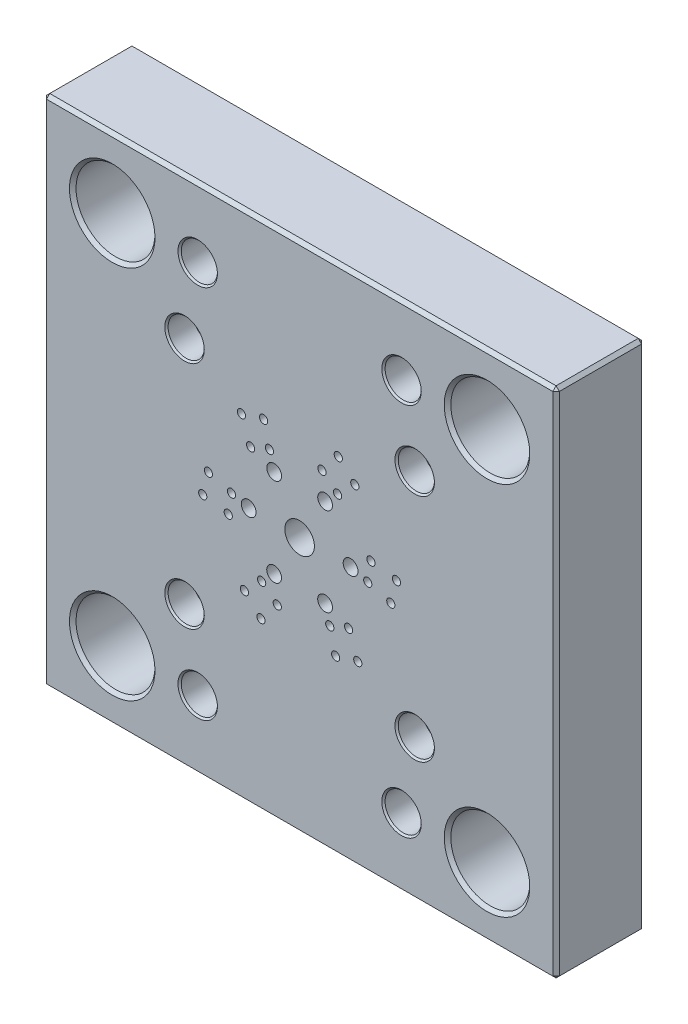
ISO-10303-21;
HEADER;
FILE_DESCRIPTION(('STEP AP214'),'2;1');
FILE_NAME('part.step','',(''),(''),'','','');
FILE_SCHEMA(('AUTOMOTIVE_DESIGN { 1 0 10303 214 1 1 1 1 }'));
ENDSEC;
DATA;
#1=APPLICATION_CONTEXT('core data for automotive mechanical design processes');
#2=APPLICATION_PROTOCOL_DEFINITION('international standard','automotive_design',2000,#1);
#3=PRODUCT_CONTEXT('',#1,'mechanical');
#4=PRODUCT('Part','Part','',(#3));
#5=PRODUCT_RELATED_PRODUCT_CATEGORY('part','',(#4));
#6=PRODUCT_DEFINITION_FORMATION('','',#4);
#7=PRODUCT_DEFINITION_CONTEXT('part definition',#1,'design');
#8=PRODUCT_DEFINITION('design','',#6,#7);
#9=PRODUCT_DEFINITION_SHAPE('','',#8);
#10=(LENGTH_UNIT() NAMED_UNIT(*) SI_UNIT(.MILLI.,.METRE.));
#11=(NAMED_UNIT(*) PLANE_ANGLE_UNIT() SI_UNIT($,.RADIAN.));
#12=(NAMED_UNIT(*) SI_UNIT($,.STERADIAN.) SOLID_ANGLE_UNIT());
#13=UNCERTAINTY_MEASURE_WITH_UNIT(LENGTH_MEASURE(1.E-05),#10,'distance_accuracy_value','');
#14=(GEOMETRIC_REPRESENTATION_CONTEXT(3) GLOBAL_UNCERTAINTY_ASSIGNED_CONTEXT((#13)) GLOBAL_UNIT_ASSIGNED_CONTEXT((#10,
#11,#12)) REPRESENTATION_CONTEXT('',''));
#15=CARTESIAN_POINT('',(0.,0.,0.));
#16=DIRECTION('',(0.,0.,1.));
#17=DIRECTION('',(1.,0.,0.));
#18=AXIS2_PLACEMENT_3D('',#15,#16,#17);
#19=CARTESIAN_POINT('',(78.,19.9999999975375,10.));
#20=DIRECTION('',(0.,-1.,0.));
#21=DIRECTION('',(0.,0.,-1.));
#22=AXIS2_PLACEMENT_3D('',#19,#20,#21);
#23=CONICAL_SURFACE('',#22,4.1879999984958,1.02974425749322);
#24=CARTESIAN_POINT('',(78.0000000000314,22.5164042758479,10.));
#25=VERTEX_POINT('',#24);
#26=VERTEX_LOOP('',#25);
#27=FACE_BOUND('',#26,.T.);
#28=CARTESIAN_POINT('',(78.,20.,10.));
#29=DIRECTION('',(0.,-1.,0.));
#30=DIRECTION('',(0.,0.,-1.));
#31=AXIS2_PLACEMENT_3D('',#28,#29,#30);
#32=CIRCLE('',#31,4.188);
#33=CARTESIAN_POINT('',(78.,20.,5.812));
#34=VERTEX_POINT('',#33);
#35=EDGE_CURVE('E117',#34,#34,#32,.T.);
#36=ORIENTED_EDGE('',*,*,#35,.T.);
#37=EDGE_LOOP('',(#36));
#38=FACE_BOUND('',#37,.T.);
#39=ADVANCED_FACE('F17',(#27,#38),#23,.F.);
#40=CARTESIAN_POINT('',(78.,10.,10.));
#41=DIRECTION('',(0.,-1.,0.));
#42=DIRECTION('',(0.,0.,-1.));
#43=AXIS2_PLACEMENT_3D('',#40,#41,#42);
#44=CYLINDRICAL_SURFACE('',#43,4.188);
#45=CARTESIAN_POINT('',(78.,0.50000000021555,10.));
#46=DIRECTION('',(0.,-1.,0.));
#47=DIRECTION('',(-1.,0.,0.));
#48=AXIS2_PLACEMENT_3D('',#45,#46,#47);
#49=CIRCLE('',#48,4.18800000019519);
#50=CARTESIAN_POINT('',(73.8119999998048,0.50000000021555,10.));
#51=VERTEX_POINT('',#50);
#52=EDGE_CURVE('E513',#51,#51,#49,.T.);
#53=ORIENTED_EDGE('',*,*,#52,.T.);
#54=EDGE_LOOP('',(#53));
#55=FACE_BOUND('',#54,.T.);
#56=ORIENTED_EDGE('',*,*,#35,.F.);
#57=EDGE_LOOP('',(#56));
#58=FACE_BOUND('',#57,.T.);
#59=ADVANCED_FACE('F114',(#55,#58),#44,.F.);
#60=CARTESIAN_POINT('',(0.500000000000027,155.5,26.));
#61=DIRECTION('',(-0.577350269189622,0.577350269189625,0.577350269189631));
#62=DIRECTION('',(0.,-0.707106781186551,0.707106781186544));
#63=AXIS2_PLACEMENT_3D('',#60,#61,#62);
#64=PLANE('',#63);
#65=DIRECTION('',(0.,-0.707106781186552,0.707106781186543));
#66=VECTOR('',#65,1.);
#67=CARTESIAN_POINT('',(1.00000000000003,155.5,26.5));
#68=LINE('',#67,#66);
#69=CARTESIAN_POINT('',(1.00000000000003,156.,26.));
#70=VERTEX_POINT('',#69);
#71=CARTESIAN_POINT('',(1.00000000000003,155.,27.));
#72=VERTEX_POINT('',#71);
#73=EDGE_CURVE('E499',#70,#72,#68,.T.);
#74=ORIENTED_EDGE('',*,*,#73,.F.);
#75=DIRECTION('',(-0.707106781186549,-0.707106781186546,0.));
#76=VECTOR('',#75,1.);
#77=CARTESIAN_POINT('',(0.500000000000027,155.5,26.));
#78=LINE('',#77,#76);
#79=CARTESIAN_POINT('',(0.,155.,26.));
#80=VERTEX_POINT('',#79);
#81=EDGE_CURVE('E503',#80,#70,#78,.F.);
#82=ORIENTED_EDGE('',*,*,#81,.F.);
#83=DIRECTION('',(0.707106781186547,0.,0.707106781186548));
#84=VECTOR('',#83,1.);
#85=CARTESIAN_POINT('',(0.500000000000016,155.,26.5));
#86=LINE('',#85,#84);
#87=EDGE_CURVE('E108',#72,#80,#86,.F.);
#88=ORIENTED_EDGE('',*,*,#87,.F.);
#89=EDGE_LOOP('',(#74,#82,#88));
#90=FACE_BOUND('',#89,.T.);
#91=ADVANCED_FACE('F934',(#90),#64,.T.);
#92=CARTESIAN_POINT('',(0.499999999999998,0.5,26.));
#93=DIRECTION('',(-0.577350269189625,-0.577350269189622,0.57735026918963));
#94=DIRECTION('',(0.707106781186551,0.,0.707106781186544));
#95=AXIS2_PLACEMENT_3D('',#92,#93,#94);
#96=PLANE('',#95);
#97=DIRECTION('',(0.707106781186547,0.,0.707106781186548));
#98=VECTOR('',#97,1.);
#99=CARTESIAN_POINT('',(0.500000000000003,1.,26.5));
#100=LINE('',#99,#98);
#101=CARTESIAN_POINT('',(0.,1.,26.));
#102=VERTEX_POINT('',#101);
#103=CARTESIAN_POINT('',(1.,1.,27.));
#104=VERTEX_POINT('',#103);
#105=EDGE_CURVE('E496',#102,#104,#100,.T.);
#106=ORIENTED_EDGE('',*,*,#105,.F.);
#107=DIRECTION('',(0.707106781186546,-0.707106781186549,0.));
#108=VECTOR('',#107,1.);
#109=CARTESIAN_POINT('',(0.499999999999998,0.5,26.));
#110=LINE('',#109,#108);
#111=CARTESIAN_POINT('',(0.999999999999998,0.,26.));
#112=VERTEX_POINT('',#111);
#113=EDGE_CURVE('E119',#112,#102,#110,.F.);
#114=ORIENTED_EDGE('',*,*,#113,.F.);
#115=DIRECTION('',(0.,-0.707106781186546,-0.707106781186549));
#116=VECTOR('',#115,1.);
#117=CARTESIAN_POINT('',(1.,0.499999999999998,26.5));
#118=LINE('',#117,#116);
#119=EDGE_CURVE('E494',#104,#112,#118,.T.);
#120=ORIENTED_EDGE('',*,*,#119,.F.);
#121=EDGE_LOOP('',(#106,#114,#120));
#122=FACE_BOUND('',#121,.T.);
#123=ADVANCED_FACE('F930',(#122),#96,.T.);
#124=CARTESIAN_POINT('',(155.5,0.499999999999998,26.));
#125=DIRECTION('',(0.577350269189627,-0.577350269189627,0.577350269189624));
#126=DIRECTION('',(0.707106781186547,0.707106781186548,0.));
#127=AXIS2_PLACEMENT_3D('',#124,#125,#126);
#128=PLANE('',#127);
#129=DIRECTION('',(0.707106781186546,0.,-0.707106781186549));
#130=VECTOR('',#129,1.);
#131=CARTESIAN_POINT('',(155.5,1.,26.5));
#132=LINE('',#131,#130);
#133=CARTESIAN_POINT('',(155.,1.,27.));
#134=VERTEX_POINT('',#133);
#135=CARTESIAN_POINT('',(156.,0.999999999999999,26.));
#136=VERTEX_POINT('',#135);
#137=EDGE_CURVE('E490',#134,#136,#132,.T.);
#138=ORIENTED_EDGE('',*,*,#137,.F.);
#139=DIRECTION('',(0.,-0.707106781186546,-0.707106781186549));
#140=VECTOR('',#139,1.);
#141=CARTESIAN_POINT('',(155.,0.499999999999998,26.5));
#142=LINE('',#141,#140);
#143=CARTESIAN_POINT('',(155.,0.,26.));
#144=VERTEX_POINT('',#143);
#145=EDGE_CURVE('E492',#144,#134,#142,.F.);
#146=ORIENTED_EDGE('',*,*,#145,.F.);
#147=DIRECTION('',(0.707106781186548,0.707106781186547,0.));
#148=VECTOR('',#147,1.);
#149=CARTESIAN_POINT('',(155.5,0.499999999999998,26.));
#150=LINE('',#149,#148);
#151=EDGE_CURVE('E511',#136,#144,#150,.F.);
#152=ORIENTED_EDGE('',*,*,#151,.F.);
#153=EDGE_LOOP('',(#138,#146,#152));
#154=FACE_BOUND('',#153,.T.);
#155=ADVANCED_FACE('F926',(#154),#128,.T.);
#156=CARTESIAN_POINT('',(155.5,155.5,26.));
#157=DIRECTION('',(0.577350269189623,0.577350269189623,0.577350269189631));
#158=DIRECTION('',(0.,-0.707106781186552,0.707106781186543));
#159=AXIS2_PLACEMENT_3D('',#156,#157,#158);
#160=PLANE('',#159);
#161=DIRECTION('',(0.,-0.707106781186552,0.707106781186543));
#162=VECTOR('',#161,1.);
#163=CARTESIAN_POINT('',(155.,155.5,26.5));
#164=LINE('',#163,#162);
#165=CARTESIAN_POINT('',(155.,155.,27.));
#166=VERTEX_POINT('',#165);
#167=CARTESIAN_POINT('',(155.,156.,26.));
#168=VERTEX_POINT('',#167);
#169=EDGE_CURVE('E501',#166,#168,#164,.F.);
#170=ORIENTED_EDGE('',*,*,#169,.F.);
#171=DIRECTION('',(0.707106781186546,0.,-0.707106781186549));
#172=VECTOR('',#171,1.);
#173=CARTESIAN_POINT('',(155.5,155.,26.5));
#174=LINE('',#173,#172);
#175=CARTESIAN_POINT('',(156.,155.,26.));
#176=VERTEX_POINT('',#175);
#177=EDGE_CURVE('E486',#176,#166,#174,.F.);
#178=ORIENTED_EDGE('',*,*,#177,.F.);
#179=DIRECTION('',(-0.707106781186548,0.707106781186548,0.));
#180=VECTOR('',#179,1.);
#181=CARTESIAN_POINT('',(155.5,155.5,26.));
#182=LINE('',#181,#180);
#183=EDGE_CURVE('E507',#168,#176,#182,.F.);
#184=ORIENTED_EDGE('',*,*,#183,.F.);
#185=EDGE_LOOP('',(#170,#178,#184));
#186=FACE_BOUND('',#185,.T.);
#187=ADVANCED_FACE('F923',(#186),#160,.T.);
#188=CARTESIAN_POINT('',(0.499999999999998,0.5,0.));
#189=DIRECTION('',(-0.707106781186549,-0.707106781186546,0.));
#190=DIRECTION('',(0.707106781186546,-0.707106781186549,0.));
#191=AXIS2_PLACEMENT_3D('',#188,#189,#190);
#192=PLANE('',#191);
#193=DIRECTION('',(0.707106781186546,-0.707106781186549,0.));
#194=VECTOR('',#193,1.);
#195=CARTESIAN_POINT('',(0.499999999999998,0.5,1.));
#196=LINE('',#195,#194);
#197=CARTESIAN_POINT('',(0.,1.,1.));
#198=VERTEX_POINT('',#197);
#199=CARTESIAN_POINT('',(0.999999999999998,0.,1.));
#200=VERTEX_POINT('',#199);
#201=EDGE_CURVE('E121',#198,#200,#196,.T.);
#202=ORIENTED_EDGE('',*,*,#201,.T.);
#203=DIRECTION('',(0.,0.,-1.));
#204=VECTOR('',#203,1.);
#205=CARTESIAN_POINT('',(1.,0.,0.));
#206=LINE('',#205,#204);
#207=EDGE_CURVE('E457',#112,#200,#206,.T.);
#208=ORIENTED_EDGE('',*,*,#207,.F.);
#209=ORIENTED_EDGE('',*,*,#113,.T.);
#210=DIRECTION('',(0.,0.,1.));
#211=VECTOR('',#210,1.);
#212=CARTESIAN_POINT('',(0.,1.,0.));
#213=LINE('',#212,#211);
#214=EDGE_CURVE('E463',#198,#102,#213,.T.);
#215=ORIENTED_EDGE('',*,*,#214,.F.);
#216=EDGE_LOOP('',(#202,#208,#209,#215));
#217=FACE_BOUND('',#216,.T.);
#218=ADVANCED_FACE('F520',(#217),#192,.T.);
#219=CARTESIAN_POINT('',(78.,-2.27373675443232E-10,10.));
#220=DIRECTION('',(0.,-1.,0.));
#221=DIRECTION('',(0.,0.,-1.));
#222=AXIS2_PLACEMENT_3D('',#219,#220,#221);
#223=CONICAL_SURFACE('',#222,4.68799999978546,0.785398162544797);
#224=CARTESIAN_POINT('',(78.,-2.27373675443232E-10,10.));
#225=DIRECTION('',(0.,-1.,0.));
#226=DIRECTION('',(0.,0.,-1.));
#227=AXIS2_PLACEMENT_3D('',#224,#225,#226);
#228=CIRCLE('',#227,4.68799999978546);
#229=CARTESIAN_POINT('',(78.,-2.27373675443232E-10,5.31200000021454));
#230=VERTEX_POINT('',#229);
#231=EDGE_CURVE('E20',#230,#230,#228,.F.);
#232=ORIENTED_EDGE('',*,*,#231,.F.);
#233=EDGE_LOOP('',(#232));
#234=FACE_BOUND('',#233,.T.);
#235=ORIENTED_EDGE('',*,*,#52,.F.);
#236=EDGE_LOOP('',(#235));
#237=FACE_BOUND('',#236,.T.);
#238=ADVANCED_FACE('F916',(#234,#237),#223,.F.);
#239=CARTESIAN_POINT('',(155.5,0.499999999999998,0.));
#240=DIRECTION('',(0.707106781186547,-0.707106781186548,0.));
#241=DIRECTION('',(0.707106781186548,0.707106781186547,0.));
#242=AXIS2_PLACEMENT_3D('',#239,#240,#241);
#243=PLANE('',#242);
#244=DIRECTION('',(0.707106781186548,0.707106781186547,0.));
#245=VECTOR('',#244,1.);
#246=CARTESIAN_POINT('',(155.5,0.499999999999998,1.));
#247=LINE('',#246,#245);
#248=CARTESIAN_POINT('',(155.,0.,0.999999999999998));
#249=VERTEX_POINT('',#248);
#250=CARTESIAN_POINT('',(156.,0.999999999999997,1.00000000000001));
#251=VERTEX_POINT('',#250);
#252=EDGE_CURVE('E509',#249,#251,#247,.T.);
#253=ORIENTED_EDGE('',*,*,#252,.T.);
#254=DIRECTION('',(0.,0.,-1.));
#255=VECTOR('',#254,1.);
#256=CARTESIAN_POINT('',(156.,1.,0.));
#257=LINE('',#256,#255);
#258=EDGE_CURVE('E442',#136,#251,#257,.T.);
#259=ORIENTED_EDGE('',*,*,#258,.F.);
#260=ORIENTED_EDGE('',*,*,#151,.T.);
#261=DIRECTION('',(0.,0.,-1.));
#262=VECTOR('',#261,1.);
#263=CARTESIAN_POINT('',(155.,0.,0.));
#264=LINE('',#263,#262);
#265=EDGE_CURVE('E454',#249,#144,#264,.F.);
#266=ORIENTED_EDGE('',*,*,#265,.F.);
#267=EDGE_LOOP('',(#253,#259,#260,#266));
#268=FACE_BOUND('',#267,.T.);
#269=ADVANCED_FACE('F912',(#268),#243,.T.);
#270=CARTESIAN_POINT('',(155.5,155.5,0.));
#271=DIRECTION('',(0.707106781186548,0.707106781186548,0.));
#272=DIRECTION('',(-0.707106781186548,0.707106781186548,0.));
#273=AXIS2_PLACEMENT_3D('',#270,#271,#272);
#274=PLANE('',#273);
#275=DIRECTION('',(-0.707106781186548,0.707106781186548,0.));
#276=VECTOR('',#275,1.);
#277=CARTESIAN_POINT('',(155.5,155.5,1.));
#278=LINE('',#277,#276);
#279=CARTESIAN_POINT('',(156.,155.,0.999999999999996));
#280=VERTEX_POINT('',#279);
#281=CARTESIAN_POINT('',(155.,156.,0.999999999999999));
#282=VERTEX_POINT('',#281);
#283=EDGE_CURVE('E505',#280,#282,#278,.T.);
#284=ORIENTED_EDGE('',*,*,#283,.T.);
#285=DIRECTION('',(0.,0.,1.));
#286=VECTOR('',#285,1.);
#287=CARTESIAN_POINT('',(155.,156.,0.));
#288=LINE('',#287,#286);
#289=EDGE_CURVE('E434',#168,#282,#288,.F.);
#290=ORIENTED_EDGE('',*,*,#289,.F.);
#291=ORIENTED_EDGE('',*,*,#183,.T.);
#292=DIRECTION('',(0.,0.,-1.));
#293=VECTOR('',#292,1.);
#294=CARTESIAN_POINT('',(156.,155.,0.));
#295=LINE('',#294,#293);
#296=EDGE_CURVE('E448',#280,#176,#295,.F.);
#297=ORIENTED_EDGE('',*,*,#296,.F.);
#298=EDGE_LOOP('',(#284,#290,#291,#297));
#299=FACE_BOUND('',#298,.T.);
#300=ADVANCED_FACE('F908',(#299),#274,.T.);
#301=CARTESIAN_POINT('',(0.500000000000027,155.5,0.));
#302=DIRECTION('',(-0.707106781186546,0.707106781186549,0.));
#303=DIRECTION('',(-0.707106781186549,-0.707106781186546,0.));
#304=AXIS2_PLACEMENT_3D('',#301,#302,#303);
#305=PLANE('',#304);
#306=DIRECTION('',(-0.707106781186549,-0.707106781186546,0.));
#307=VECTOR('',#306,1.);
#308=CARTESIAN_POINT('',(0.750000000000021,155.75,1.00000000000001));
#309=LINE('',#308,#307);
#310=CARTESIAN_POINT('',(0.,155.,1.));
#311=VERTEX_POINT('',#310);
#312=CARTESIAN_POINT('',(1.00000000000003,156.,1.));
#313=VERTEX_POINT('',#312);
#314=EDGE_CURVE('E440',#311,#313,#309,.F.);
#315=ORIENTED_EDGE('',*,*,#314,.F.);
#316=DIRECTION('',(0.,0.,1.));
#317=VECTOR('',#316,1.);
#318=CARTESIAN_POINT('',(0.,155.,0.));
#319=LINE('',#318,#317);
#320=EDGE_CURVE('E466',#80,#311,#319,.F.);
#321=ORIENTED_EDGE('',*,*,#320,.F.);
#322=ORIENTED_EDGE('',*,*,#81,.T.);
#323=DIRECTION('',(0.,0.,1.));
#324=VECTOR('',#323,1.);
#325=CARTESIAN_POINT('',(1.00000000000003,156.,0.));
#326=LINE('',#325,#324);
#327=EDGE_CURVE('E431',#313,#70,#326,.T.);
#328=ORIENTED_EDGE('',*,*,#327,.F.);
#329=EDGE_LOOP('',(#315,#321,#322,#328));
#330=FACE_BOUND('',#329,.T.);
#331=ADVANCED_FACE('F904',(#330),#305,.T.);
#332=CARTESIAN_POINT('',(39.,155.5,26.5));
#333=DIRECTION('',(0.,0.707106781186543,0.707106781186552));
#334=DIRECTION('',(0.,-0.707106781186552,0.707106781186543));
#335=AXIS2_PLACEMENT_3D('',#332,#333,#334);
#336=PLANE('',#335);
#337=ORIENTED_EDGE('',*,*,#73,.T.);
#338=DIRECTION('',(1.,0.,0.));
#339=VECTOR('',#338,1.);
#340=CARTESIAN_POINT('',(78.,155.,27.));
#341=LINE('',#340,#339);
#342=EDGE_CURVE('E429',#166,#72,#341,.F.);
#343=ORIENTED_EDGE('',*,*,#342,.F.);
#344=ORIENTED_EDGE('',*,*,#169,.T.);
#345=DIRECTION('',(1.,0.,0.));
#346=VECTOR('',#345,1.);
#347=CARTESIAN_POINT('',(0.,156.,26.));
#348=LINE('',#347,#346);
#349=EDGE_CURVE('E437',#70,#168,#348,.T.);
#350=ORIENTED_EDGE('',*,*,#349,.F.);
#351=EDGE_LOOP('',(#337,#343,#344,#350));
#352=FACE_BOUND('',#351,.T.);
#353=ADVANCED_FACE('F901',(#352),#336,.T.);
#354=CARTESIAN_POINT('',(0.500000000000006,39.,26.5));
#355=DIRECTION('',(-0.707106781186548,0.,0.707106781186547));
#356=DIRECTION('',(0.707106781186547,0.,0.707106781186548));
#357=AXIS2_PLACEMENT_3D('',#354,#355,#356);
#358=PLANE('',#357);
#359=ORIENTED_EDGE('',*,*,#105,.T.);
#360=DIRECTION('',(0.,1.,0.));
#361=VECTOR('',#360,1.);
#362=CARTESIAN_POINT('',(1.00000000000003,78.,27.));
#363=LINE('',#362,#361);
#364=EDGE_CURVE('E421',#72,#104,#363,.F.);
#365=ORIENTED_EDGE('',*,*,#364,.F.);
#366=ORIENTED_EDGE('',*,*,#87,.T.);
#367=DIRECTION('',(0.,1.,0.));
#368=VECTOR('',#367,1.);
#369=CARTESIAN_POINT('',(0.,0.,26.));
#370=LINE('',#369,#368);
#371=EDGE_CURVE('E460',#102,#80,#370,.T.);
#372=ORIENTED_EDGE('',*,*,#371,.F.);
#373=EDGE_LOOP('',(#359,#365,#366,#372));
#374=FACE_BOUND('',#373,.T.);
#375=ADVANCED_FACE('F897',(#374),#358,.T.);
#376=CARTESIAN_POINT('',(117.,0.499999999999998,26.5));
#377=DIRECTION('',(0.,-0.707106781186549,0.707106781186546));
#378=DIRECTION('',(0.,-0.707106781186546,-0.707106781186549));
#379=AXIS2_PLACEMENT_3D('',#376,#377,#378);
#380=PLANE('',#379);
#381=ORIENTED_EDGE('',*,*,#145,.T.);
#382=DIRECTION('',(1.,0.,0.));
#383=VECTOR('',#382,1.);
#384=CARTESIAN_POINT('',(78.,1.,27.));
#385=LINE('',#384,#383);
#386=EDGE_CURVE('E414',#104,#134,#385,.T.);
#387=ORIENTED_EDGE('',*,*,#386,.F.);
#388=ORIENTED_EDGE('',*,*,#119,.T.);
#389=DIRECTION('',(1.,0.,0.));
#390=VECTOR('',#389,1.);
#391=CARTESIAN_POINT('',(156.,0.,26.));
#392=LINE('',#391,#390);
#393=EDGE_CURVE('E451',#144,#112,#392,.F.);
#394=ORIENTED_EDGE('',*,*,#393,.F.);
#395=EDGE_LOOP('',(#381,#387,#388,#394));
#396=FACE_BOUND('',#395,.T.);
#397=ADVANCED_FACE('F893',(#396),#380,.T.);
#398=CARTESIAN_POINT('',(155.5,117.,26.5));
#399=DIRECTION('',(0.707106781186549,0.,0.707106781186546));
#400=DIRECTION('',(0.707106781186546,0.,-0.707106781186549));
#401=AXIS2_PLACEMENT_3D('',#398,#399,#400);
#402=PLANE('',#401);
#403=ORIENTED_EDGE('',*,*,#177,.T.);
#404=DIRECTION('',(0.,1.,0.));
#405=VECTOR('',#404,1.);
#406=CARTESIAN_POINT('',(155.,78.,27.));
#407=LINE('',#406,#405);
#408=EDGE_CURVE('E410',#134,#166,#407,.T.);
#409=ORIENTED_EDGE('',*,*,#408,.F.);
#410=ORIENTED_EDGE('',*,*,#137,.T.);
#411=DIRECTION('',(0.,1.,0.));
#412=VECTOR('',#411,1.);
#413=CARTESIAN_POINT('',(156.,156.,26.));
#414=LINE('',#413,#412);
#415=EDGE_CURVE('E445',#176,#136,#414,.F.);
#416=ORIENTED_EDGE('',*,*,#415,.F.);
#417=EDGE_LOOP('',(#403,#409,#410,#416));
#418=FACE_BOUND('',#417,.T.);
#419=ADVANCED_FACE('F889',(#418),#402,.T.);
#420=CARTESIAN_POINT('',(113.,113.,27.0000000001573));
#421=DIRECTION('',(0.,0.,1.));
#422=DIRECTION('',(1.,0.,0.));
#423=AXIS2_PLACEMENT_3D('',#420,#421,#422);
#424=CONICAL_SURFACE('',#423,5.9999999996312,0.785398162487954);
#425=CARTESIAN_POINT('',(113.,113.,27.0000000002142));
#426=DIRECTION('',(0.,0.,1.));
#427=DIRECTION('',(1.,0.,0.));
#428=AXIS2_PLACEMENT_3D('',#425,#426,#427);
#429=CIRCLE('',#428,5.99999999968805);
#430=CARTESIAN_POINT('',(118.999999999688,113.,27.0000000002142));
#431=VERTEX_POINT('',#430);
#432=EDGE_CURVE('E385',#431,#431,#429,.F.);
#433=ORIENTED_EDGE('',*,*,#432,.F.);
#434=EDGE_LOOP('',(#433));
#435=FACE_BOUND('',#434,.T.);
#436=CARTESIAN_POINT('',(113.,113.,26.5));
#437=DIRECTION('',(0.,0.,1.));
#438=DIRECTION('',(1.,0.,0.));
#439=AXIS2_PLACEMENT_3D('',#436,#437,#438);
#440=CIRCLE('',#439,5.5);
#441=CARTESIAN_POINT('',(118.5,113.,26.5));
#442=VERTEX_POINT('',#441);
#443=EDGE_CURVE('E468',#442,#442,#440,.F.);
#444=ORIENTED_EDGE('',*,*,#443,.T.);
#445=EDGE_LOOP('',(#444));
#446=FACE_BOUND('',#445,.T.);
#447=ADVANCED_FACE('F885',(#435,#446),#424,.F.);
#448=CARTESIAN_POINT('',(43.,43.,27.0000000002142));
#449=DIRECTION('',(0.,0.,1.));
#450=DIRECTION('',(1.,0.,0.));
#451=AXIS2_PLACEMENT_3D('',#448,#449,#450);
#452=CONICAL_SURFACE('',#451,5.99999999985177,0.785398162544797);
#453=CARTESIAN_POINT('',(43.,43.,27.0000000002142));
#454=DIRECTION('',(0.,0.,1.));
#455=DIRECTION('',(1.,0.,0.));
#456=AXIS2_PLACEMENT_3D('',#453,#454,#455);
#457=CIRCLE('',#456,5.99999999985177);
#458=CARTESIAN_POINT('',(48.9999999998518,43.,27.0000000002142));
#459=VERTEX_POINT('',#458);
#460=EDGE_CURVE('E382',#459,#459,#457,.F.);
#461=ORIENTED_EDGE('',*,*,#460,.F.);
#462=EDGE_LOOP('',(#461));
#463=FACE_BOUND('',#462,.T.);
#464=CARTESIAN_POINT('',(43.,43.,26.5));
#465=DIRECTION('',(0.,0.,1.));
#466=DIRECTION('',(1.,0.,0.));
#467=AXIS2_PLACEMENT_3D('',#464,#465,#466);
#468=CIRCLE('',#467,5.5);
#469=CARTESIAN_POINT('',(48.5,43.,26.5));
#470=VERTEX_POINT('',#469);
#471=EDGE_CURVE('E471',#470,#470,#468,.F.);
#472=ORIENTED_EDGE('',*,*,#471,.T.);
#473=EDGE_LOOP('',(#472));
#474=FACE_BOUND('',#473,.T.);
#475=ADVANCED_FACE('F881',(#463,#474),#452,.F.);
#476=CARTESIAN_POINT('',(43.,113.,27.0000000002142));
#477=DIRECTION('',(0.,0.,1.));
#478=DIRECTION('',(1.,0.,0.));
#479=AXIS2_PLACEMENT_3D('',#476,#477,#478);
#480=CONICAL_SURFACE('',#479,5.99999999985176,0.785398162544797);
#481=CARTESIAN_POINT('',(43.,113.,27.0000000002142));
#482=DIRECTION('',(0.,0.,1.));
#483=DIRECTION('',(1.,0.,0.));
#484=AXIS2_PLACEMENT_3D('',#481,#482,#483);
#485=CIRCLE('',#484,5.99999999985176);
#486=CARTESIAN_POINT('',(48.9999999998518,113.,27.0000000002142));
#487=VERTEX_POINT('',#486);
#488=EDGE_CURVE('E379',#487,#487,#485,.F.);
#489=ORIENTED_EDGE('',*,*,#488,.F.);
#490=EDGE_LOOP('',(#489));
#491=FACE_BOUND('',#490,.T.);
#492=CARTESIAN_POINT('',(43.,113.,26.5));
#493=DIRECTION('',(0.,0.,1.));
#494=DIRECTION('',(1.,0.,0.));
#495=AXIS2_PLACEMENT_3D('',#492,#493,#494);
#496=CIRCLE('',#495,5.5);
#497=CARTESIAN_POINT('',(48.5,113.,26.5));
#498=VERTEX_POINT('',#497);
#499=EDGE_CURVE('E476',#498,#498,#496,.F.);
#500=ORIENTED_EDGE('',*,*,#499,.T.);
#501=EDGE_LOOP('',(#500));
#502=FACE_BOUND('',#501,.T.);
#503=ADVANCED_FACE('F877',(#491,#502),#480,.F.);
#504=CARTESIAN_POINT('',(113.,43.,27.0000000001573));
#505=DIRECTION('',(0.,0.,1.));
#506=DIRECTION('',(1.,0.,0.));
#507=AXIS2_PLACEMENT_3D('',#504,#505,#506);
#508=CONICAL_SURFACE('',#507,5.9999999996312,0.785398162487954);
#509=CARTESIAN_POINT('',(113.,43.,27.0000000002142));
#510=DIRECTION('',(0.,0.,1.));
#511=DIRECTION('',(1.,0.,0.));
#512=AXIS2_PLACEMENT_3D('',#509,#510,#511);
#513=CIRCLE('',#512,5.99999999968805);
#514=CARTESIAN_POINT('',(118.999999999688,43.,27.0000000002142));
#515=VERTEX_POINT('',#514);
#516=EDGE_CURVE('E375',#515,#515,#513,.F.);
#517=ORIENTED_EDGE('',*,*,#516,.F.);
#518=EDGE_LOOP('',(#517));
#519=FACE_BOUND('',#518,.T.);
#520=CARTESIAN_POINT('',(113.,43.,26.5));
#521=DIRECTION('',(0.,0.,1.));
#522=DIRECTION('',(1.,0.,0.));
#523=AXIS2_PLACEMENT_3D('',#520,#521,#522);
#524=CIRCLE('',#523,5.5);
#525=CARTESIAN_POINT('',(118.5,43.,26.5));
#526=VERTEX_POINT('',#525);
#527=EDGE_CURVE('E481',#526,#526,#524,.F.);
#528=ORIENTED_EDGE('',*,*,#527,.T.);
#529=EDGE_LOOP('',(#528));
#530=FACE_BOUND('',#529,.T.);
#531=ADVANCED_FACE('F873',(#519,#530),#508,.F.);
#532=CARTESIAN_POINT('',(109.,21.,27.0000000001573));
#533=DIRECTION('',(0.,0.,1.));
#534=DIRECTION('',(1.,0.,0.));
#535=AXIS2_PLACEMENT_3D('',#532,#533,#534);
#536=CONICAL_SURFACE('',#535,5.99999999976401,0.785398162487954);
#537=CARTESIAN_POINT('',(109.,21.,27.0000000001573));
#538=DIRECTION('',(0.,0.,1.));
#539=DIRECTION('',(1.,0.,0.));
#540=AXIS2_PLACEMENT_3D('',#537,#538,#539);
#541=CIRCLE('',#540,5.99999999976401);
#542=CARTESIAN_POINT('',(114.999999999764,21.,27.0000000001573));
#543=VERTEX_POINT('',#542);
#544=EDGE_CURVE('E400',#543,#543,#541,.F.);
#545=ORIENTED_EDGE('',*,*,#544,.F.);
#546=EDGE_LOOP('',(#545));
#547=FACE_BOUND('',#546,.T.);
#548=CARTESIAN_POINT('',(109.,21.,26.5));
#549=DIRECTION('',(0.,0.,1.));
#550=DIRECTION('',(1.,0.,0.));
#551=AXIS2_PLACEMENT_3D('',#548,#549,#550);
#552=CIRCLE('',#551,5.5);
#553=CARTESIAN_POINT('',(114.5,21.,26.5));
#554=VERTEX_POINT('',#553);
#555=EDGE_CURVE('E378',#554,#554,#552,.F.);
#556=ORIENTED_EDGE('',*,*,#555,.T.);
#557=EDGE_LOOP('',(#556));
#558=FACE_BOUND('',#557,.T.);
#559=ADVANCED_FACE('F593',(#547,#558),#536,.F.);
#560=CARTESIAN_POINT('',(109.,135.,27.0000000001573));
#561=DIRECTION('',(0.,0.,1.));
#562=DIRECTION('',(1.,0.,0.));
#563=AXIS2_PLACEMENT_3D('',#560,#561,#562);
#564=CONICAL_SURFACE('',#563,5.99999999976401,0.785398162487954);
#565=CARTESIAN_POINT('',(109.,135.,27.0000000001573));
#566=DIRECTION('',(0.,0.,1.));
#567=DIRECTION('',(1.,0.,0.));
#568=AXIS2_PLACEMENT_3D('',#565,#566,#567);
#569=CIRCLE('',#568,5.99999999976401);
#570=CARTESIAN_POINT('',(114.999999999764,135.,27.0000000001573));
#571=VERTEX_POINT('',#570);
#572=EDGE_CURVE('E403',#571,#571,#569,.F.);
#573=ORIENTED_EDGE('',*,*,#572,.F.);
#574=EDGE_LOOP('',(#573));
#575=FACE_BOUND('',#574,.T.);
#576=CARTESIAN_POINT('',(109.,135.,26.5));
#577=DIRECTION('',(0.,0.,1.));
#578=DIRECTION('',(1.,0.,0.));
#579=AXIS2_PLACEMENT_3D('',#576,#577,#578);
#580=CIRCLE('',#579,5.5);
#581=CARTESIAN_POINT('',(114.5,135.,26.5));
#582=VERTEX_POINT('',#581);
#583=EDGE_CURVE('E584',#582,#582,#580,.F.);
#584=ORIENTED_EDGE('',*,*,#583,.T.);
#585=EDGE_LOOP('',(#584));
#586=FACE_BOUND('',#585,.T.);
#587=ADVANCED_FACE('F856',(#575,#586),#564,.F.);
#588=CARTESIAN_POINT('',(135.,135.,27.0000000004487));
#589=DIRECTION('',(0.,0.,1.));
#590=DIRECTION('',(0.,-1.,0.));
#591=AXIS2_PLACEMENT_3D('',#588,#589,#590);
#592=CONICAL_SURFACE('',#591,13.0052499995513,0.785398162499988);
#593=CARTESIAN_POINT('',(135.,135.,27.0000000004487));
#594=DIRECTION('',(0.,0.,1.));
#595=DIRECTION('',(0.,-1.,0.));
#596=AXIS2_PLACEMENT_3D('',#593,#594,#595);
#597=CIRCLE('',#596,13.0052499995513);
#598=CARTESIAN_POINT('',(135.,121.994750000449,27.0000000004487));
#599=VERTEX_POINT('',#598);
#600=EDGE_CURVE('E397',#599,#599,#597,.F.);
#601=ORIENTED_EDGE('',*,*,#600,.F.);
#602=EDGE_LOOP('',(#601));
#603=FACE_BOUND('',#602,.T.);
#604=CARTESIAN_POINT('',(135.,135.,26.));
#605=DIRECTION('',(0.,0.,1.));
#606=DIRECTION('',(1.,0.,0.));
#607=AXIS2_PLACEMENT_3D('',#604,#605,#606);
#608=CIRCLE('',#607,12.00525);
#609=CARTESIAN_POINT('',(147.00525,135.,26.));
#610=VERTEX_POINT('',#609);
#611=EDGE_CURVE('E579',#610,#610,#608,.F.);
#612=ORIENTED_EDGE('',*,*,#611,.T.);
#613=EDGE_LOOP('',(#612));
#614=FACE_BOUND('',#613,.T.);
#615=ADVANCED_FACE('F853',(#603,#614),#592,.F.);
#616=CARTESIAN_POINT('',(21.,21.,27.0000000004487));
#617=DIRECTION('',(0.,0.,1.));
#618=DIRECTION('',(0.,-1.,0.));
#619=AXIS2_PLACEMENT_3D('',#616,#617,#618);
#620=CONICAL_SURFACE('',#619,13.0052499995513,0.785398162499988);
#621=CARTESIAN_POINT('',(21.,21.,27.0000000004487));
#622=DIRECTION('',(0.,0.,1.));
#623=DIRECTION('',(0.,-1.,0.));
#624=AXIS2_PLACEMENT_3D('',#621,#622,#623);
#625=CIRCLE('',#624,13.0052499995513);
#626=CARTESIAN_POINT('',(21.,7.99475000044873,27.0000000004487));
#627=VERTEX_POINT('',#626);
#628=EDGE_CURVE('E394',#627,#627,#625,.F.);
#629=ORIENTED_EDGE('',*,*,#628,.F.);
#630=EDGE_LOOP('',(#629));
#631=FACE_BOUND('',#630,.T.);
#632=CARTESIAN_POINT('',(21.,21.,26.));
#633=DIRECTION('',(0.,0.,1.));
#634=DIRECTION('',(1.,0.,0.));
#635=AXIS2_PLACEMENT_3D('',#632,#633,#634);
#636=CIRCLE('',#635,12.00525);
#637=CARTESIAN_POINT('',(33.00525,21.,26.));
#638=VERTEX_POINT('',#637);
#639=EDGE_CURVE('E374',#638,#638,#636,.F.);
#640=ORIENTED_EDGE('',*,*,#639,.T.);
#641=EDGE_LOOP('',(#640));
#642=FACE_BOUND('',#641,.T.);
#643=ADVANCED_FACE('F855',(#631,#642),#620,.F.);
#644=CARTESIAN_POINT('',(113.,43.,23.));
#645=DIRECTION('',(0.,0.,1.));
#646=DIRECTION('',(1.,0.,0.));
#647=AXIS2_PLACEMENT_3D('',#644,#645,#646);
#648=CYLINDRICAL_SURFACE('',#647,5.5);
#649=ORIENTED_EDGE('',*,*,#527,.F.);
#650=EDGE_LOOP('',(#649));
#651=FACE_BOUND('',#650,.T.);
#652=CARTESIAN_POINT('',(113.,43.,19.));
#653=DIRECTION('',(0.,0.,1.));
#654=DIRECTION('',(1.,0.,0.));
#655=AXIS2_PLACEMENT_3D('',#652,#653,#654);
#656=CIRCLE('',#655,5.5);
#657=CARTESIAN_POINT('',(118.5,43.,19.));
#658=VERTEX_POINT('',#657);
#659=EDGE_CURVE('E371',#658,#658,#656,.T.);
#660=ORIENTED_EDGE('',*,*,#659,.F.);
#661=EDGE_LOOP('',(#660));
#662=FACE_BOUND('',#661,.T.);
#663=ADVANCED_FACE('F863',(#651,#662),#648,.F.);
#664=CARTESIAN_POINT('',(43.,113.,23.));
#665=DIRECTION('',(0.,0.,1.));
#666=DIRECTION('',(1.,0.,0.));
#667=AXIS2_PLACEMENT_3D('',#664,#665,#666);
#668=CYLINDRICAL_SURFACE('',#667,5.5);
#669=ORIENTED_EDGE('',*,*,#499,.F.);
#670=EDGE_LOOP('',(#669));
#671=FACE_BOUND('',#670,.T.);
#672=CARTESIAN_POINT('',(43.,113.,19.));
#673=DIRECTION('',(0.,0.,1.));
#674=DIRECTION('',(1.,0.,0.));
#675=AXIS2_PLACEMENT_3D('',#672,#673,#674);
#676=CIRCLE('',#675,5.5);
#677=CARTESIAN_POINT('',(48.5,113.,19.));
#678=VERTEX_POINT('',#677);
#679=EDGE_CURVE('E368',#678,#678,#676,.T.);
#680=ORIENTED_EDGE('',*,*,#679,.F.);
#681=EDGE_LOOP('',(#680));
#682=FACE_BOUND('',#681,.T.);
#683=ADVANCED_FACE('F1040',(#671,#682),#668,.F.);
#684=CARTESIAN_POINT('',(43.,43.,23.));
#685=DIRECTION('',(0.,0.,1.));
#686=DIRECTION('',(1.,0.,0.));
#687=AXIS2_PLACEMENT_3D('',#684,#685,#686);
#688=CYLINDRICAL_SURFACE('',#687,5.5);
#689=ORIENTED_EDGE('',*,*,#471,.F.);
#690=EDGE_LOOP('',(#689));
#691=FACE_BOUND('',#690,.T.);
#692=CARTESIAN_POINT('',(43.,43.,19.));
#693=DIRECTION('',(0.,0.,1.));
#694=DIRECTION('',(1.,0.,0.));
#695=AXIS2_PLACEMENT_3D('',#692,#693,#694);
#696=CIRCLE('',#695,5.5);
#697=CARTESIAN_POINT('',(48.5,43.,19.));
#698=VERTEX_POINT('',#697);
#699=EDGE_CURVE('E365',#698,#698,#696,.T.);
#700=ORIENTED_EDGE('',*,*,#699,.F.);
#701=EDGE_LOOP('',(#700));
#702=FACE_BOUND('',#701,.T.);
#703=ADVANCED_FACE('F1047',(#691,#702),#688,.F.);
#704=CARTESIAN_POINT('',(113.,113.,23.));
#705=DIRECTION('',(0.,0.,1.));
#706=DIRECTION('',(1.,0.,0.));
#707=AXIS2_PLACEMENT_3D('',#704,#705,#706);
#708=CYLINDRICAL_SURFACE('',#707,5.5);
#709=ORIENTED_EDGE('',*,*,#443,.F.);
#710=EDGE_LOOP('',(#709));
#711=FACE_BOUND('',#710,.T.);
#712=CARTESIAN_POINT('',(113.,113.,19.));
#713=DIRECTION('',(0.,0.,1.));
#714=DIRECTION('',(1.,0.,0.));
#715=AXIS2_PLACEMENT_3D('',#712,#713,#714);
#716=CIRCLE('',#715,5.5);
#717=CARTESIAN_POINT('',(118.5,113.,19.));
#718=VERTEX_POINT('',#717);
#719=EDGE_CURVE('E361',#718,#718,#716,.T.);
#720=ORIENTED_EDGE('',*,*,#719,.F.);
#721=EDGE_LOOP('',(#720));
#722=FACE_BOUND('',#721,.T.);
#723=ADVANCED_FACE('F1055',(#711,#722),#708,.F.);
#724=CARTESIAN_POINT('',(135.,21.,27.0000000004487));
#725=DIRECTION('',(0.,0.,1.));
#726=DIRECTION('',(0.,-1.,0.));
#727=AXIS2_PLACEMENT_3D('',#724,#725,#726);
#728=CONICAL_SURFACE('',#727,13.0052499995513,0.785398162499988);
#729=CARTESIAN_POINT('',(135.,21.,27.0000000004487));
#730=DIRECTION('',(0.,0.,1.));
#731=DIRECTION('',(0.,-1.,0.));
#732=AXIS2_PLACEMENT_3D('',#729,#730,#731);
#733=CIRCLE('',#732,13.0052499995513);
#734=CARTESIAN_POINT('',(135.,7.99475000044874,27.0000000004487));
#735=VERTEX_POINT('',#734);
#736=EDGE_CURVE('E391',#735,#735,#733,.F.);
#737=ORIENTED_EDGE('',*,*,#736,.F.);
#738=EDGE_LOOP('',(#737));
#739=FACE_BOUND('',#738,.T.);
#740=CARTESIAN_POINT('',(135.,21.,26.));
#741=DIRECTION('',(0.,0.,1.));
#742=DIRECTION('',(1.,0.,0.));
#743=AXIS2_PLACEMENT_3D('',#740,#741,#742);
#744=CIRCLE('',#743,12.00525);
#745=CARTESIAN_POINT('',(147.00525,21.,26.));
#746=VERTEX_POINT('',#745);
#747=EDGE_CURVE('E364',#746,#746,#744,.F.);
#748=ORIENTED_EDGE('',*,*,#747,.T.);
#749=EDGE_LOOP('',(#748));
#750=FACE_BOUND('',#749,.T.);
#751=ADVANCED_FACE('F1063',(#739,#750),#728,.F.);
#752=CARTESIAN_POINT('',(21.,135.,27.0000000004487));
#753=DIRECTION('',(0.,0.,1.));
#754=DIRECTION('',(0.,-1.,0.));
#755=AXIS2_PLACEMENT_3D('',#752,#753,#754);
#756=CONICAL_SURFACE('',#755,13.0052499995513,0.785398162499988);
#757=CARTESIAN_POINT('',(21.,135.,27.0000000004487));
#758=DIRECTION('',(0.,0.,1.));
#759=DIRECTION('',(0.,-1.,0.));
#760=AXIS2_PLACEMENT_3D('',#757,#758,#759);
#761=CIRCLE('',#760,13.0052499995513);
#762=CARTESIAN_POINT('',(21.,121.994750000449,27.0000000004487));
#763=VERTEX_POINT('',#762);
#764=EDGE_CURVE('E388',#763,#763,#761,.F.);
#765=ORIENTED_EDGE('',*,*,#764,.F.);
#766=EDGE_LOOP('',(#765));
#767=FACE_BOUND('',#766,.T.);
#768=CARTESIAN_POINT('',(21.,135.,26.));
#769=DIRECTION('',(0.,0.,1.));
#770=DIRECTION('',(1.,0.,0.));
#771=AXIS2_PLACEMENT_3D('',#768,#769,#770);
#772=CIRCLE('',#771,12.00525);
#773=CARTESIAN_POINT('',(33.00525,135.,26.));
#774=VERTEX_POINT('',#773);
#775=EDGE_CURVE('E566',#774,#774,#772,.F.);
#776=ORIENTED_EDGE('',*,*,#775,.T.);
#777=EDGE_LOOP('',(#776));
#778=FACE_BOUND('',#777,.T.);
#779=ADVANCED_FACE('F1071',(#767,#778),#756,.F.);
#780=CARTESIAN_POINT('',(47.,135.,27.0000000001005));
#781=DIRECTION('',(0.,0.,1.));
#782=DIRECTION('',(0.,-1.,0.));
#783=AXIS2_PLACEMENT_3D('',#780,#781,#782);
#784=CONICAL_SURFACE('',#783,5.99999999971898,0.785398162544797);
#785=CARTESIAN_POINT('',(47.,135.,27.0000000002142));
#786=DIRECTION('',(0.,0.,1.));
#787=DIRECTION('',(0.,-1.,0.));
#788=AXIS2_PLACEMENT_3D('',#785,#786,#787);
#789=CIRCLE('',#788,5.99999999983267);
#790=CARTESIAN_POINT('',(47.,129.000000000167,27.0000000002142));
#791=VERTEX_POINT('',#790);
#792=EDGE_CURVE('E408',#791,#791,#789,.F.);
#793=ORIENTED_EDGE('',*,*,#792,.F.);
#794=EDGE_LOOP('',(#793));
#795=FACE_BOUND('',#794,.T.);
#796=CARTESIAN_POINT('',(47.,135.,26.5));
#797=DIRECTION('',(0.,0.,1.));
#798=DIRECTION('',(1.,0.,0.));
#799=AXIS2_PLACEMENT_3D('',#796,#797,#798);
#800=CIRCLE('',#799,5.5);
#801=CARTESIAN_POINT('',(52.5,135.,26.5));
#802=VERTEX_POINT('',#801);
#803=EDGE_CURVE('E561',#802,#802,#800,.F.);
#804=ORIENTED_EDGE('',*,*,#803,.T.);
#805=EDGE_LOOP('',(#804));
#806=FACE_BOUND('',#805,.T.);
#807=ADVANCED_FACE('F1079',(#795,#806),#784,.F.);
#808=CARTESIAN_POINT('',(47.,21.,27.0000000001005));
#809=DIRECTION('',(0.,0.,1.));
#810=DIRECTION('',(0.,-1.,0.));
#811=AXIS2_PLACEMENT_3D('',#808,#809,#810);
#812=CONICAL_SURFACE('',#811,5.99999999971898,0.785398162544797);
#813=CARTESIAN_POINT('',(47.,21.,27.0000000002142));
#814=DIRECTION('',(0.,0.,1.));
#815=DIRECTION('',(0.,-1.,0.));
#816=AXIS2_PLACEMENT_3D('',#813,#814,#815);
#817=CIRCLE('',#816,5.99999999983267);
#818=CARTESIAN_POINT('',(47.,15.0000000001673,27.0000000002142));
#819=VERTEX_POINT('',#818);
#820=EDGE_CURVE('E406',#819,#819,#817,.F.);
#821=ORIENTED_EDGE('',*,*,#820,.F.);
#822=EDGE_LOOP('',(#821));
#823=FACE_BOUND('',#822,.T.);
#824=CARTESIAN_POINT('',(47.,21.,26.5));
#825=DIRECTION('',(0.,0.,1.));
#826=DIRECTION('',(1.,0.,0.));
#827=AXIS2_PLACEMENT_3D('',#824,#825,#826);
#828=CIRCLE('',#827,5.5);
#829=CARTESIAN_POINT('',(52.5,21.,26.5));
#830=VERTEX_POINT('',#829);
#831=EDGE_CURVE('E558',#830,#830,#828,.F.);
#832=ORIENTED_EDGE('',*,*,#831,.T.);
#833=EDGE_LOOP('',(#832));
#834=FACE_BOUND('',#833,.T.);
#835=ADVANCED_FACE('F1087',(#823,#834),#812,.F.);
#836=CARTESIAN_POINT('',(0.,0.,0.));
#837=DIRECTION('',(-1.,0.,0.));
#838=DIRECTION('',(0.,0.,1.));
#839=AXIS2_PLACEMENT_3D('',#836,#837,#838);
#840=PLANE('',#839);
#841=ORIENTED_EDGE('',*,*,#214,.T.);
#842=ORIENTED_EDGE('',*,*,#371,.T.);
#843=ORIENTED_EDGE('',*,*,#320,.T.);
#844=DIRECTION('',(0.,1.,0.));
#845=VECTOR('',#844,1.);
#846=CARTESIAN_POINT('',(0.,39.,1.));
#847=LINE('',#846,#845);
#848=EDGE_CURVE('E554',#198,#311,#847,.T.);
#849=ORIENTED_EDGE('',*,*,#848,.F.);
#850=EDGE_LOOP('',(#841,#842,#843,#849));
#851=FACE_BOUND('',#850,.T.);
#852=ADVANCED_FACE('F1095',(#851),#840,.T.);
#853=CARTESIAN_POINT('',(156.,0.,0.));
#854=DIRECTION('',(0.,-1.,0.));
#855=DIRECTION('',(0.,0.,-1.));
#856=AXIS2_PLACEMENT_3D('',#853,#854,#855);
#857=PLANE('',#856);
#858=ORIENTED_EDGE('',*,*,#231,.T.);
#859=EDGE_LOOP('',(#858));
#860=FACE_BOUND('',#859,.T.);
#861=ORIENTED_EDGE('',*,*,#265,.T.);
#862=ORIENTED_EDGE('',*,*,#393,.T.);
#863=ORIENTED_EDGE('',*,*,#207,.T.);
#864=DIRECTION('',(1.,0.,0.));
#865=VECTOR('',#864,1.);
#866=CARTESIAN_POINT('',(117.,0.,1.));
#867=LINE('',#866,#865);
#868=EDGE_CURVE('E530',#249,#200,#867,.F.);
#869=ORIENTED_EDGE('',*,*,#868,.F.);
#870=EDGE_LOOP('',(#861,#862,#863,#869));
#871=FACE_BOUND('',#870,.T.);
#872=ADVANCED_FACE('F529',(#860,#871),#857,.T.);
#873=CARTESIAN_POINT('',(0.999999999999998,0.499999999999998,0.5));
#874=DIRECTION('',(-0.577350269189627,-0.577350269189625,-0.577350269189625));
#875=DIRECTION('',(-0.707106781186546,0.,0.707106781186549));
#876=AXIS2_PLACEMENT_3D('',#873,#874,#875);
#877=PLANE('',#876);
#878=ORIENTED_EDGE('',*,*,#201,.F.);
#879=DIRECTION('',(-0.707106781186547,0.,0.707106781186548));
#880=VECTOR('',#879,1.);
#881=CARTESIAN_POINT('',(0.500000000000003,0.999999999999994,0.499999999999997));
#882=LINE('',#881,#880);
#883=CARTESIAN_POINT('',(1.00000000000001,0.999999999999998,0.));
#884=VERTEX_POINT('',#883);
#885=EDGE_CURVE('E542',#884,#198,#882,.T.);
#886=ORIENTED_EDGE('',*,*,#885,.F.);
#887=DIRECTION('',(0.,0.707106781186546,-0.707106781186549));
#888=VECTOR('',#887,1.);
#889=CARTESIAN_POINT('',(1.,0.499999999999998,0.5));
#890=LINE('',#889,#888);
#891=EDGE_CURVE('E536',#200,#884,#890,.T.);
#892=ORIENTED_EDGE('',*,*,#891,.F.);
#893=EDGE_LOOP('',(#878,#886,#892));
#894=FACE_BOUND('',#893,.T.);
#895=ADVANCED_FACE('F541',(#894),#877,.T.);
#896=CARTESIAN_POINT('',(156.,156.,0.));
#897=DIRECTION('',(1.,0.,0.));
#898=DIRECTION('',(0.,0.,-1.));
#899=AXIS2_PLACEMENT_3D('',#896,#897,#898);
#900=PLANE('',#899);
#901=ORIENTED_EDGE('',*,*,#258,.T.);
#902=DIRECTION('',(0.,1.,0.));
#903=VECTOR('',#902,1.);
#904=CARTESIAN_POINT('',(156.,117.,1.00000000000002));
#905=LINE('',#904,#903);
#906=EDGE_CURVE('E547',#280,#251,#905,.F.);
#907=ORIENTED_EDGE('',*,*,#906,.F.);
#908=ORIENTED_EDGE('',*,*,#296,.T.);
#909=ORIENTED_EDGE('',*,*,#415,.T.);
#910=EDGE_LOOP('',(#901,#907,#908,#909));
#911=FACE_BOUND('',#910,.T.);
#912=ADVANCED_FACE('F1117',(#911),#900,.T.);
#913=CARTESIAN_POINT('',(155.,0.499999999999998,0.5));
#914=DIRECTION('',(0.577350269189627,-0.577350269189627,-0.577350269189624));
#915=DIRECTION('',(0.707106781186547,0.707106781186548,0.));
#916=AXIS2_PLACEMENT_3D('',#913,#914,#915);
#917=PLANE('',#916);
#918=DIRECTION('',(-0.707106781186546,0.,-0.707106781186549));
#919=VECTOR('',#918,1.);
#920=CARTESIAN_POINT('',(155.5,1.,0.500000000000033));
#921=LINE('',#920,#919);
#922=CARTESIAN_POINT('',(155.,0.999999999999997,0.));
#923=VERTEX_POINT('',#922);
#924=EDGE_CURVE('E1407',#251,#923,#921,.T.);
#925=ORIENTED_EDGE('',*,*,#924,.F.);
#926=ORIENTED_EDGE('',*,*,#252,.F.);
#927=DIRECTION('',(0.,0.707106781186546,-0.707106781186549));
#928=VECTOR('',#927,1.);
#929=CARTESIAN_POINT('',(155.,0.499999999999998,0.5));
#930=LINE('',#929,#928);
#931=EDGE_CURVE('E538',#923,#249,#930,.F.);
#932=ORIENTED_EDGE('',*,*,#931,.F.);
#933=EDGE_LOOP('',(#925,#926,#932));
#934=FACE_BOUND('',#933,.T.);
#935=ADVANCED_FACE('F1124',(#934),#917,.T.);
#936=CARTESIAN_POINT('',(1.00000000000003,155.5,0.5));
#937=DIRECTION('',(-0.577350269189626,0.577350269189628,-0.577350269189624));
#938=DIRECTION('',(-0.707106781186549,-0.707106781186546,0.));
#939=AXIS2_PLACEMENT_3D('',#936,#937,#938);
#940=PLANE('',#939);
#941=ORIENTED_EDGE('',*,*,#314,.T.);
#942=DIRECTION('',(0.,0.707106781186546,0.707106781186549));
#943=VECTOR('',#942,1.);
#944=CARTESIAN_POINT('',(1.00000000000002,155.5,0.499999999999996));
#945=LINE('',#944,#943);
#946=CARTESIAN_POINT('',(1.00000000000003,155.,0.));
#947=VERTEX_POINT('',#946);
#948=EDGE_CURVE('E1408',#947,#313,#945,.T.);
#949=ORIENTED_EDGE('',*,*,#948,.F.);
#950=DIRECTION('',(-0.707106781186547,0.,0.707106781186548));
#951=VECTOR('',#950,1.);
#952=CARTESIAN_POINT('',(0.500000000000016,155.,0.50000000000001));
#953=LINE('',#952,#951);
#954=EDGE_CURVE('E552',#311,#947,#953,.F.);
#955=ORIENTED_EDGE('',*,*,#954,.F.);
#956=EDGE_LOOP('',(#941,#949,#955));
#957=FACE_BOUND('',#956,.T.);
#958=ADVANCED_FACE('F1132',(#957),#940,.T.);
#959=CARTESIAN_POINT('',(0.,156.,0.));
#960=DIRECTION('',(0.,1.,0.));
#961=DIRECTION('',(0.,0.,1.));
#962=AXIS2_PLACEMENT_3D('',#959,#960,#961);
#963=PLANE('',#962);
#964=DIRECTION('',(1.,0.,0.));
#965=VECTOR('',#964,1.);
#966=CARTESIAN_POINT('',(39.,156.,1.));
#967=LINE('',#966,#965);
#968=EDGE_CURVE('E1413',#313,#282,#967,.T.);
#969=ORIENTED_EDGE('',*,*,#968,.F.);
#970=ORIENTED_EDGE('',*,*,#327,.T.);
#971=ORIENTED_EDGE('',*,*,#349,.T.);
#972=ORIENTED_EDGE('',*,*,#289,.T.);
#973=EDGE_LOOP('',(#969,#970,#971,#972));
#974=FACE_BOUND('',#973,.T.);
#975=ADVANCED_FACE('F1140',(#974),#963,.T.);
#976=CARTESIAN_POINT('',(155.5,155.,0.5));
#977=DIRECTION('',(0.577350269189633,0.577350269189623,-0.577350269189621));
#978=DIRECTION('',(-0.707106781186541,0.707106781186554,0.));
#979=AXIS2_PLACEMENT_3D('',#976,#977,#978);
#980=PLANE('',#979);
#981=ORIENTED_EDGE('',*,*,#283,.F.);
#982=DIRECTION('',(-0.707106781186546,0.,-0.707106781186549));
#983=VECTOR('',#982,1.);
#984=CARTESIAN_POINT('',(155.5,155.,0.499999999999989));
#985=LINE('',#984,#983);
#986=CARTESIAN_POINT('',(155.,155.,0.));
#987=VERTEX_POINT('',#986);
#988=EDGE_CURVE('E544',#987,#280,#985,.F.);
#989=ORIENTED_EDGE('',*,*,#988,.F.);
#990=DIRECTION('',(0.,0.707106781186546,0.707106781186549));
#991=VECTOR('',#990,1.);
#992=CARTESIAN_POINT('',(155.,155.5,0.500000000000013));
#993=LINE('',#992,#991);
#994=EDGE_CURVE('E35',#282,#987,#993,.F.);
#995=ORIENTED_EDGE('',*,*,#994,.F.);
#996=EDGE_LOOP('',(#981,#989,#995));
#997=FACE_BOUND('',#996,.T.);
#998=ADVANCED_FACE('F609',(#997),#980,.T.);
#999=CARTESIAN_POINT('',(78.,78.,27.));
#1000=DIRECTION('',(0.,0.,1.));
#1001=DIRECTION('',(1.,0.,0.));
#1002=AXIS2_PLACEMENT_3D('',#999,#1000,#1001);
#1003=PLANE('',#1002);
#1004=ORIENTED_EDGE('',*,*,#516,.T.);
#1005=EDGE_LOOP('',(#1004));
#1006=FACE_BOUND('',#1005,.T.);
#1007=ORIENTED_EDGE('',*,*,#488,.T.);
#1008=EDGE_LOOP('',(#1007));
#1009=FACE_BOUND('',#1008,.T.);
#1010=ORIENTED_EDGE('',*,*,#460,.T.);
#1011=EDGE_LOOP('',(#1010));
#1012=FACE_BOUND('',#1011,.T.);
#1013=ORIENTED_EDGE('',*,*,#432,.T.);
#1014=EDGE_LOOP('',(#1013));
#1015=FACE_BOUND('',#1014,.T.);
#1016=ORIENTED_EDGE('',*,*,#764,.T.);
#1017=EDGE_LOOP('',(#1016));
#1018=FACE_BOUND('',#1017,.T.);
#1019=ORIENTED_EDGE('',*,*,#736,.T.);
#1020=EDGE_LOOP('',(#1019));
#1021=FACE_BOUND('',#1020,.T.);
#1022=ORIENTED_EDGE('',*,*,#628,.T.);
#1023=EDGE_LOOP('',(#1022));
#1024=FACE_BOUND('',#1023,.T.);
#1025=ORIENTED_EDGE('',*,*,#600,.T.);
#1026=EDGE_LOOP('',(#1025));
#1027=FACE_BOUND('',#1026,.T.);
#1028=ORIENTED_EDGE('',*,*,#544,.T.);
#1029=EDGE_LOOP('',(#1028));
#1030=FACE_BOUND('',#1029,.T.);
#1031=ORIENTED_EDGE('',*,*,#572,.T.);
#1032=EDGE_LOOP('',(#1031));
#1033=FACE_BOUND('',#1032,.T.);
#1034=ORIENTED_EDGE('',*,*,#820,.T.);
#1035=EDGE_LOOP('',(#1034));
#1036=FACE_BOUND('',#1035,.T.);
#1037=ORIENTED_EDGE('',*,*,#792,.T.);
#1038=EDGE_LOOP('',(#1037));
#1039=FACE_BOUND('',#1038,.T.);
#1040=CARTESIAN_POINT('',(78.,78.,27.));
#1041=DIRECTION('',(0.,0.,-1.));
#1042=DIRECTION('',(-1.,0.,0.));
#1043=AXIS2_PLACEMENT_3D('',#1040,#1041,#1042);
#1044=CIRCLE('',#1043,4.49999999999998);
#1045=CARTESIAN_POINT('',(73.5000000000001,78.,27.));
#1046=VERTEX_POINT('',#1045);
#1047=EDGE_CURVE('E267',#1046,#1046,#1044,.T.);
#1048=ORIENTED_EDGE('',*,*,#1047,.T.);
#1049=EDGE_LOOP('',(#1048));
#1050=FACE_BOUND('',#1049,.T.);
#1051=CARTESIAN_POINT('',(50.2557164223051,81.3671472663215,27.));
#1052=DIRECTION('',(0.,0.,1.));
#1053=DIRECTION('',(1.,0.,0.));
#1054=AXIS2_PLACEMENT_3D('',#1051,#1052,#1053);
#1055=CIRCLE('',#1054,1.25);
#1056=CARTESIAN_POINT('',(51.5057164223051,81.3671472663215,27.));
#1057=VERTEX_POINT('',#1056);
#1058=EDGE_CURVE('E271',#1057,#1057,#1055,.F.);
#1059=ORIENTED_EDGE('',*,*,#1058,.T.);
#1060=EDGE_LOOP('',(#1059));
#1061=FACE_BOUND('',#1060,.T.);
#1062=CARTESIAN_POINT('',(48.5468446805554,74.5789400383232,27.));
#1063=DIRECTION('',(0.,0.,1.));
#1064=DIRECTION('',(1.,0.,0.));
#1065=AXIS2_PLACEMENT_3D('',#1062,#1063,#1064);
#1066=CIRCLE('',#1065,1.25);
#1067=CARTESIAN_POINT('',(49.7968446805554,74.5789400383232,27.));
#1068=VERTEX_POINT('',#1067);
#1069=EDGE_CURVE('E274',#1068,#1068,#1066,.F.);
#1070=ORIENTED_EDGE('',*,*,#1069,.T.);
#1071=EDGE_LOOP('',(#1070));
#1072=FACE_BOUND('',#1071,.T.);
#1073=CARTESIAN_POINT('',(57.2751539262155,79.3693741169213,27.));
#1074=DIRECTION('',(0.,0.,1.));
#1075=DIRECTION('',(1.,0.,0.));
#1076=AXIS2_PLACEMENT_3D('',#1073,#1074,#1075);
#1077=CIRCLE('',#1076,1.25);
#1078=CARTESIAN_POINT('',(58.5251539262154,79.3693741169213,27.));
#1079=VERTEX_POINT('',#1078);
#1080=EDGE_CURVE('E277',#1079,#1079,#1077,.F.);
#1081=ORIENTED_EDGE('',*,*,#1080,.T.);
#1082=EDGE_LOOP('',(#1081));
#1083=FACE_BOUND('',#1082,.T.);
#1084=CARTESIAN_POINT('',(56.3018832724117,73.3187967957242,27.));
#1085=DIRECTION('',(0.,0.,1.));
#1086=DIRECTION('',(1.,0.,0.));
#1087=AXIS2_PLACEMENT_3D('',#1084,#1085,#1086);
#1088=CIRCLE('',#1087,1.25);
#1089=CARTESIAN_POINT('',(57.5518832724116,73.3187967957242,27.));
#1090=VERTEX_POINT('',#1089);
#1091=EDGE_CURVE('E280',#1090,#1090,#1088,.F.);
#1092=ORIENTED_EDGE('',*,*,#1091,.T.);
#1093=EDGE_LOOP('',(#1092));
#1094=FACE_BOUND('',#1093,.T.);
#1095=CARTESIAN_POINT('',(62.5000000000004,78.0029999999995,27.));
#1096=DIRECTION('',(0.,0.,1.));
#1097=DIRECTION('',(1.,0.,0.));
#1098=AXIS2_PLACEMENT_3D('',#1095,#1096,#1097);
#1099=CIRCLE('',#1098,2.24999999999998);
#1100=CARTESIAN_POINT('',(64.7500000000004,78.0029999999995,27.));
#1101=VERTEX_POINT('',#1100);
#1102=EDGE_CURVE('E283',#1101,#1101,#1099,.F.);
#1103=ORIENTED_EDGE('',*,*,#1102,.T.);
#1104=EDGE_LOOP('',(#1103));
#1105=FACE_BOUND('',#1104,.T.);
#1106=CARTESIAN_POINT('',(71.2049825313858,56.8682780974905,27.));
#1107=DIRECTION('',(0.,0.,1.));
#1108=DIRECTION('',(1.,0.,0.));
#1109=AXIS2_PLACEMENT_3D('',#1106,#1107,#1108);
#1110=CIRCLE('',#1109,1.25);
#1111=CARTESIAN_POINT('',(72.4549825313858,56.8682780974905,27.));
#1112=VERTEX_POINT('',#1111);
#1113=EDGE_CURVE('E286',#1112,#1112,#1110,.F.);
#1114=ORIENTED_EDGE('',*,*,#1113,.T.);
#1115=EDGE_LOOP('',(#1114));
#1116=FACE_BOUND('',#1115,.T.);
#1117=CARTESIAN_POINT('',(66.451664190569,60.736443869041,27.));
#1118=DIRECTION('',(0.,0.,1.));
#1119=DIRECTION('',(1.,0.,0.));
#1120=AXIS2_PLACEMENT_3D('',#1117,#1118,#1119);
#1121=CIRCLE('',#1120,1.25);
#1122=CARTESIAN_POINT('',(67.701664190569,60.736443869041,27.));
#1123=VERTEX_POINT('',#1122);
#1124=EDGE_CURVE('E289',#1123,#1123,#1121,.F.);
#1125=ORIENTED_EDGE('',*,*,#1124,.T.);
#1126=EDGE_LOOP('',(#1125));
#1127=FACE_BOUND('',#1126,.T.);
#1128=CARTESIAN_POINT('',(66.2361471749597,50.7822892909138,27.));
#1129=DIRECTION('',(0.,0.,1.));
#1130=DIRECTION('',(1.,0.,0.));
#1131=AXIS2_PLACEMENT_3D('',#1128,#1129,#1130);
#1132=CIRCLE('',#1131,1.25);
#1133=CARTESIAN_POINT('',(67.4861471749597,50.7822892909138,27.));
#1134=VERTEX_POINT('',#1133);
#1135=EDGE_CURVE('E292',#1134,#1134,#1132,.F.);
#1136=ORIENTED_EDGE('',*,*,#1135,.T.);
#1137=EDGE_LOOP('',(#1136));
#1138=FACE_BOUND('',#1137,.T.);
#1139=CARTESIAN_POINT('',(61.2118231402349,55.6563192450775,27.));
#1140=DIRECTION('',(0.,0.,1.));
#1141=DIRECTION('',(1.,0.,0.));
#1142=AXIS2_PLACEMENT_3D('',#1139,#1140,#1141);
#1143=CIRCLE('',#1142,1.25);
#1144=CARTESIAN_POINT('',(62.4618231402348,55.6563192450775,27.));
#1145=VERTEX_POINT('',#1144);
#1146=EDGE_CURVE('E295',#1145,#1145,#1143,.F.);
#1147=ORIENTED_EDGE('',*,*,#1146,.T.);
#1148=EDGE_LOOP('',(#1147));
#1149=FACE_BOUND('',#1148,.T.);
#1150=CARTESIAN_POINT('',(70.2474019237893,64.5781062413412,27.));
#1151=DIRECTION('',(0.,0.,1.));
#1152=DIRECTION('',(1.,0.,0.));
#1153=AXIS2_PLACEMENT_3D('',#1150,#1151,#1152);
#1154=CIRCLE('',#1153,2.24999999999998);
#1155=CARTESIAN_POINT('',(72.4974019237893,64.5781062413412,27.));
#1156=VERTEX_POINT('',#1155);
#1157=EDGE_CURVE('E298',#1156,#1156,#1154,.F.);
#1158=ORIENTED_EDGE('',*,*,#1157,.T.);
#1159=EDGE_LOOP('',(#1158));
#1160=FACE_BOUND('',#1159,.T.);
#1161=CARTESIAN_POINT('',(92.9030992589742,61.5494813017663,27.));
#1162=DIRECTION('',(0.,0.,1.));
#1163=DIRECTION('',(1.,0.,0.));
#1164=AXIS2_PLACEMENT_3D('',#1161,#1162,#1163);
#1165=CIRCLE('',#1164,1.25);
#1166=CARTESIAN_POINT('',(94.1530992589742,61.5494813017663,27.));
#1167=VERTEX_POINT('',#1166);
#1168=EDGE_CURVE('E301',#1167,#1167,#1165,.F.);
#1169=ORIENTED_EDGE('',*,*,#1168,.T.);
#1170=EDGE_LOOP('',(#1169));
#1171=FACE_BOUND('',#1170,.T.);
#1172=CARTESIAN_POINT('',(87.1765102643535,59.3670697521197,27.));
#1173=DIRECTION('',(0.,0.,1.));
#1174=DIRECTION('',(1.,0.,0.));
#1175=AXIS2_PLACEMENT_3D('',#1172,#1173,#1174);
#1176=CIRCLE('',#1175,1.25);
#1177=CARTESIAN_POINT('',(88.4265102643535,59.3670697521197,27.));
#1178=VERTEX_POINT('',#1177);
#1179=EDGE_CURVE('E304',#1178,#1178,#1176,.F.);
#1180=ORIENTED_EDGE('',*,*,#1179,.T.);
#1181=EDGE_LOOP('',(#1180));
#1182=FACE_BOUND('',#1181,.T.);
#1183=CARTESIAN_POINT('',(95.6893024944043,54.2033492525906,27.));
#1184=DIRECTION('',(0.,0.,1.));
#1185=DIRECTION('',(1.,0.,0.));
#1186=AXIS2_PLACEMENT_3D('',#1183,#1184,#1185);
#1187=CIRCLE('',#1186,1.25);
#1188=CARTESIAN_POINT('',(96.9393024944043,54.2033492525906,27.));
#1189=VERTEX_POINT('',#1188);
#1190=EDGE_CURVE('E307',#1189,#1189,#1187,.F.);
#1191=ORIENTED_EDGE('',*,*,#1190,.T.);
#1192=EDGE_LOOP('',(#1191));
#1193=FACE_BOUND('',#1192,.T.);
#1194=CARTESIAN_POINT('',(88.9561067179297,52.2891719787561,27.));
#1195=DIRECTION('',(0.,0.,1.));
#1196=DIRECTION('',(1.,0.,0.));
#1197=AXIS2_PLACEMENT_3D('',#1194,#1195,#1196);
#1198=CIRCLE('',#1197,1.25);
#1199=CARTESIAN_POINT('',(90.2061067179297,52.2891719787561,27.));
#1200=VERTEX_POINT('',#1199);
#1201=EDGE_CURVE('E310',#1200,#1200,#1198,.F.);
#1202=ORIENTED_EDGE('',*,*,#1201,.T.);
#1203=EDGE_LOOP('',(#1202));
#1204=FACE_BOUND('',#1203,.T.);
#1205=CARTESIAN_POINT('',(85.7474019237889,64.5751062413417,27.));
#1206=DIRECTION('',(0.,0.,1.));
#1207=DIRECTION('',(1.,0.,0.));
#1208=AXIS2_PLACEMENT_3D('',#1205,#1206,#1207);
#1209=CIRCLE('',#1208,2.24999999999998);
#1210=CARTESIAN_POINT('',(87.9974019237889,64.5751062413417,27.));
#1211=VERTEX_POINT('',#1210);
#1212=EDGE_CURVE('E313',#1211,#1211,#1209,.F.);
#1213=ORIENTED_EDGE('',*,*,#1212,.T.);
#1214=EDGE_LOOP('',(#1213));
#1215=FACE_BOUND('',#1214,.T.);
#1216=CARTESIAN_POINT('',(99.6981167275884,82.6812032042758,27.));
#1217=DIRECTION('',(0.,0.,1.));
#1218=DIRECTION('',(1.,0.,0.));
#1219=AXIS2_PLACEMENT_3D('',#1216,#1217,#1218);
#1220=CIRCLE('',#1219,1.25);
#1221=CARTESIAN_POINT('',(100.948116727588,82.6812032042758,27.));
#1222=VERTEX_POINT('',#1221);
#1223=EDGE_CURVE('E316',#1222,#1222,#1220,.F.);
#1224=ORIENTED_EDGE('',*,*,#1223,.T.);
#1225=EDGE_LOOP('',(#1224));
#1226=FACE_BOUND('',#1225,.T.);
#1227=CARTESIAN_POINT('',(98.7248460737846,76.6306258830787,27.));
#1228=DIRECTION('',(0.,0.,1.));
#1229=DIRECTION('',(1.,0.,0.));
#1230=AXIS2_PLACEMENT_3D('',#1227,#1228,#1229);
#1231=CIRCLE('',#1230,1.25);
#1232=CARTESIAN_POINT('',(99.9748460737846,76.6306258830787,27.));
#1233=VERTEX_POINT('',#1232);
#1234=EDGE_CURVE('E319',#1233,#1233,#1231,.F.);
#1235=ORIENTED_EDGE('',*,*,#1234,.T.);
#1236=EDGE_LOOP('',(#1235));
#1237=FACE_BOUND('',#1236,.T.);
#1238=CARTESIAN_POINT('',(107.453155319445,81.4210599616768,27.));
#1239=DIRECTION('',(0.,0.,1.));
#1240=DIRECTION('',(1.,0.,0.));
#1241=AXIS2_PLACEMENT_3D('',#1238,#1239,#1240);
#1242=CIRCLE('',#1241,1.25);
#1243=CARTESIAN_POINT('',(108.703155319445,81.4210599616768,27.));
#1244=VERTEX_POINT('',#1243);
#1245=EDGE_CURVE('E322',#1244,#1244,#1242,.F.);
#1246=ORIENTED_EDGE('',*,*,#1245,.T.);
#1247=EDGE_LOOP('',(#1246));
#1248=FACE_BOUND('',#1247,.T.);
#1249=CARTESIAN_POINT('',(105.744283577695,74.6328527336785,27.));
#1250=DIRECTION('',(0.,0.,1.));
#1251=DIRECTION('',(1.,0.,0.));
#1252=AXIS2_PLACEMENT_3D('',#1249,#1250,#1251);
#1253=CIRCLE('',#1252,1.25);
#1254=CARTESIAN_POINT('',(106.994283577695,74.6328527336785,27.));
#1255=VERTEX_POINT('',#1254);
#1256=EDGE_CURVE('E325',#1255,#1255,#1253,.F.);
#1257=ORIENTED_EDGE('',*,*,#1256,.T.);
#1258=EDGE_LOOP('',(#1257));
#1259=FACE_BOUND('',#1258,.T.);
#1260=CARTESIAN_POINT('',(93.4999999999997,77.9970000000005,27.));
#1261=DIRECTION('',(0.,0.,1.));
#1262=DIRECTION('',(1.,0.,0.));
#1263=AXIS2_PLACEMENT_3D('',#1260,#1261,#1262);
#1264=CIRCLE('',#1263,2.24999999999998);
#1265=CARTESIAN_POINT('',(95.7499999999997,77.9970000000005,27.));
#1266=VERTEX_POINT('',#1265);
#1267=EDGE_CURVE('E328',#1266,#1266,#1264,.F.);
#1268=ORIENTED_EDGE('',*,*,#1267,.T.);
#1269=EDGE_LOOP('',(#1268));
#1270=FACE_BOUND('',#1269,.T.);
#1271=CARTESIAN_POINT('',(84.7950174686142,99.1317219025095,27.));
#1272=DIRECTION('',(0.,0.,1.));
#1273=DIRECTION('',(1.,0.,0.));
#1274=AXIS2_PLACEMENT_3D('',#1271,#1272,#1273);
#1275=CIRCLE('',#1274,1.25);
#1276=CARTESIAN_POINT('',(86.0450174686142,99.1317219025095,27.));
#1277=VERTEX_POINT('',#1276);
#1278=EDGE_CURVE('E331',#1277,#1277,#1275,.F.);
#1279=ORIENTED_EDGE('',*,*,#1278,.T.);
#1280=EDGE_LOOP('',(#1279));
#1281=FACE_BOUND('',#1280,.T.);
#1282=CARTESIAN_POINT('',(89.5483358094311,95.2635561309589,27.));
#1283=DIRECTION('',(0.,0.,1.));
#1284=DIRECTION('',(1.,0.,0.));
#1285=AXIS2_PLACEMENT_3D('',#1282,#1283,#1284);
#1286=CIRCLE('',#1285,1.25);
#1287=CARTESIAN_POINT('',(90.7983358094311,95.2635561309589,27.));
#1288=VERTEX_POINT('',#1287);
#1289=EDGE_CURVE('E334',#1288,#1288,#1286,.F.);
#1290=ORIENTED_EDGE('',*,*,#1289,.T.);
#1291=EDGE_LOOP('',(#1290));
#1292=FACE_BOUND('',#1291,.T.);
#1293=CARTESIAN_POINT('',(89.7638528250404,105.217710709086,27.));
#1294=DIRECTION('',(0.,0.,1.));
#1295=DIRECTION('',(1.,0.,0.));
#1296=AXIS2_PLACEMENT_3D('',#1293,#1294,#1295);
#1297=CIRCLE('',#1296,1.25);
#1298=CARTESIAN_POINT('',(91.0138528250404,105.217710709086,27.));
#1299=VERTEX_POINT('',#1298);
#1300=EDGE_CURVE('E337',#1299,#1299,#1297,.F.);
#1301=ORIENTED_EDGE('',*,*,#1300,.T.);
#1302=EDGE_LOOP('',(#1301));
#1303=FACE_BOUND('',#1302,.T.);
#1304=CARTESIAN_POINT('',(94.7881768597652,100.343680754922,27.));
#1305=DIRECTION('',(0.,0.,1.));
#1306=DIRECTION('',(1.,0.,0.));
#1307=AXIS2_PLACEMENT_3D('',#1304,#1305,#1306);
#1308=CIRCLE('',#1307,1.25);
#1309=CARTESIAN_POINT('',(96.0381768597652,100.343680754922,27.));
#1310=VERTEX_POINT('',#1309);
#1311=EDGE_CURVE('E340',#1310,#1310,#1308,.F.);
#1312=ORIENTED_EDGE('',*,*,#1311,.T.);
#1313=EDGE_LOOP('',(#1312));
#1314=FACE_BOUND('',#1313,.T.);
#1315=CARTESIAN_POINT('',(85.7525980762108,91.4218937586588,27.));
#1316=DIRECTION('',(0.,0.,1.));
#1317=DIRECTION('',(1.,0.,0.));
#1318=AXIS2_PLACEMENT_3D('',#1315,#1316,#1317);
#1319=CIRCLE('',#1318,2.24999999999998);
#1320=CARTESIAN_POINT('',(88.0025980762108,91.4218937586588,27.));
#1321=VERTEX_POINT('',#1320);
#1322=EDGE_CURVE('E343',#1321,#1321,#1319,.F.);
#1323=ORIENTED_EDGE('',*,*,#1322,.T.);
#1324=EDGE_LOOP('',(#1323));
#1325=FACE_BOUND('',#1324,.T.);
#1326=CARTESIAN_POINT('',(63.0969007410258,94.4505186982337,27.));
#1327=DIRECTION('',(0.,0.,1.));
#1328=DIRECTION('',(1.,0.,0.));
#1329=AXIS2_PLACEMENT_3D('',#1326,#1327,#1328);
#1330=CIRCLE('',#1329,1.25);
#1331=CARTESIAN_POINT('',(64.3469007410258,94.4505186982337,27.));
#1332=VERTEX_POINT('',#1331);
#1333=EDGE_CURVE('E346',#1332,#1332,#1330,.F.);
#1334=ORIENTED_EDGE('',*,*,#1333,.T.);
#1335=EDGE_LOOP('',(#1334));
#1336=FACE_BOUND('',#1335,.T.);
#1337=CARTESIAN_POINT('',(68.8234897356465,96.6329302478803,27.));
#1338=DIRECTION('',(0.,0.,1.));
#1339=DIRECTION('',(1.,0.,0.));
#1340=AXIS2_PLACEMENT_3D('',#1337,#1338,#1339);
#1341=CIRCLE('',#1340,1.25);
#1342=CARTESIAN_POINT('',(70.0734897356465,96.6329302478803,27.));
#1343=VERTEX_POINT('',#1342);
#1344=EDGE_CURVE('E349',#1343,#1343,#1341,.F.);
#1345=ORIENTED_EDGE('',*,*,#1344,.T.);
#1346=EDGE_LOOP('',(#1345));
#1347=FACE_BOUND('',#1346,.T.);
#1348=CARTESIAN_POINT('',(60.3106975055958,101.796650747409,27.));
#1349=DIRECTION('',(0.,0.,1.));
#1350=DIRECTION('',(1.,0.,0.));
#1351=AXIS2_PLACEMENT_3D('',#1348,#1349,#1350);
#1352=CIRCLE('',#1351,1.25);
#1353=CARTESIAN_POINT('',(61.5606975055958,101.796650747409,27.));
#1354=VERTEX_POINT('',#1353);
#1355=EDGE_CURVE('E352',#1354,#1354,#1352,.F.);
#1356=ORIENTED_EDGE('',*,*,#1355,.T.);
#1357=EDGE_LOOP('',(#1356));
#1358=FACE_BOUND('',#1357,.T.);
#1359=CARTESIAN_POINT('',(67.0438932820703,103.710828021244,27.));
#1360=DIRECTION('',(0.,0.,1.));
#1361=DIRECTION('',(1.,0.,0.));
#1362=AXIS2_PLACEMENT_3D('',#1359,#1360,#1361);
#1363=CIRCLE('',#1362,1.25);
#1364=CARTESIAN_POINT('',(68.2938932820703,103.710828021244,27.));
#1365=VERTEX_POINT('',#1364);
#1366=EDGE_CURVE('E355',#1365,#1365,#1363,.F.);
#1367=ORIENTED_EDGE('',*,*,#1366,.T.);
#1368=EDGE_LOOP('',(#1367));
#1369=FACE_BOUND('',#1368,.T.);
#1370=CARTESIAN_POINT('',(70.2525980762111,91.4248937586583,27.));
#1371=DIRECTION('',(0.,0.,1.));
#1372=DIRECTION('',(1.,0.,0.));
#1373=AXIS2_PLACEMENT_3D('',#1370,#1371,#1372);
#1374=CIRCLE('',#1373,2.24999999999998);
#1375=CARTESIAN_POINT('',(72.5025980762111,91.4248937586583,27.));
#1376=VERTEX_POINT('',#1375);
#1377=EDGE_CURVE('E358',#1376,#1376,#1374,.F.);
#1378=ORIENTED_EDGE('',*,*,#1377,.T.);
#1379=EDGE_LOOP('',(#1378));
#1380=FACE_BOUND('',#1379,.T.);
#1381=ORIENTED_EDGE('',*,*,#386,.T.);
#1382=ORIENTED_EDGE('',*,*,#408,.T.);
#1383=ORIENTED_EDGE('',*,*,#342,.T.);
#1384=ORIENTED_EDGE('',*,*,#364,.T.);
#1385=EDGE_LOOP('',(#1381,#1382,#1383,#1384));
#1386=FACE_BOUND('',#1385,.T.);
#1387=ADVANCED_FACE('F598',(#1006,#1009,#1012,#1015,#1018,#1021,#1024,#1027,#1030,#1033,#1036,
#1039,#1050,#1061,#1072,#1083,#1094,#1105,#1116,#1127,#1138,#1149,#1160,#1171,#1182,#1193,#1204,
#1215,#1226,#1237,#1248,#1259,#1270,#1281,#1292,#1303,#1314,#1325,#1336,#1347,#1358,#1369,#1380,
#1386),#1003,.T.);
#1388=CARTESIAN_POINT('',(109.,21.,-195.263357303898));
#1389=DIRECTION('',(0.,0.,1.));
#1390=DIRECTION('',(1.,0.,0.));
#1391=AXIS2_PLACEMENT_3D('',#1388,#1389,#1390);
#1392=CYLINDRICAL_SURFACE('',#1391,5.5);
#1393=CARTESIAN_POINT('',(109.,21.,0.50000000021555));
#1394=DIRECTION('',(0.,0.,-1.));
#1395=DIRECTION('',(1.,0.,0.));
#1396=AXIS2_PLACEMENT_3D('',#1393,#1394,#1395);
#1397=CIRCLE('',#1396,5.50000000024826);
#1398=CARTESIAN_POINT('',(114.500000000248,21.,0.50000000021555));
#1399=VERTEX_POINT('',#1398);
#1400=EDGE_CURVE('E270',#1399,#1399,#1397,.T.);
#1401=ORIENTED_EDGE('',*,*,#1400,.T.);
#1402=EDGE_LOOP('',(#1401));
#1403=FACE_BOUND('',#1402,.T.);
#1404=ORIENTED_EDGE('',*,*,#555,.F.);
#1405=EDGE_LOOP('',(#1404));
#1406=FACE_BOUND('',#1405,.T.);
#1407=ADVANCED_FACE('F595',(#1403,#1406),#1392,.F.);
#1408=CARTESIAN_POINT('',(109.,135.,-195.263357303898));
#1409=DIRECTION('',(0.,0.,1.));
#1410=DIRECTION('',(1.,0.,0.));
#1411=AXIS2_PLACEMENT_3D('',#1408,#1409,#1410);
#1412=CYLINDRICAL_SURFACE('',#1411,5.5);
#1413=CARTESIAN_POINT('',(109.,135.,0.50000000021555));
#1414=DIRECTION('',(0.,0.,-1.));
#1415=DIRECTION('',(1.,0.,0.));
#1416=AXIS2_PLACEMENT_3D('',#1413,#1414,#1415);
#1417=CIRCLE('',#1416,5.50000000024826);
#1418=CARTESIAN_POINT('',(114.500000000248,135.,0.50000000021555));
#1419=VERTEX_POINT('',#1418);
#1420=EDGE_CURVE('E1419',#1419,#1419,#1417,.T.);
#1421=ORIENTED_EDGE('',*,*,#1420,.T.);
#1422=EDGE_LOOP('',(#1421));
#1423=FACE_BOUND('',#1422,.T.);
#1424=ORIENTED_EDGE('',*,*,#583,.F.);
#1425=EDGE_LOOP('',(#1424));
#1426=FACE_BOUND('',#1425,.T.);
#1427=ADVANCED_FACE('F597',(#1423,#1426),#1412,.F.);
#1428=CARTESIAN_POINT('',(135.,135.,-195.263357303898));
#1429=DIRECTION('',(0.,0.,1.));
#1430=DIRECTION('',(1.,0.,0.));
#1431=AXIS2_PLACEMENT_3D('',#1428,#1429,#1430);
#1432=CYLINDRICAL_SURFACE('',#1431,12.00525);
#1433=CARTESIAN_POINT('',(135.,135.,1.00000000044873));
#1434=DIRECTION('',(0.,0.,-1.));
#1435=DIRECTION('',(1.,0.,0.));
#1436=AXIS2_PLACEMENT_3D('',#1433,#1434,#1435);
#1437=CIRCLE('',#1436,12.0052500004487);
#1438=CARTESIAN_POINT('',(147.005250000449,135.,1.00000000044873));
#1439=VERTEX_POINT('',#1438);
#1440=EDGE_CURVE('E850',#1439,#1439,#1437,.T.);
#1441=ORIENTED_EDGE('',*,*,#1440,.T.);
#1442=EDGE_LOOP('',(#1441));
#1443=FACE_BOUND('',#1442,.T.);
#1444=ORIENTED_EDGE('',*,*,#611,.F.);
#1445=EDGE_LOOP('',(#1444));
#1446=FACE_BOUND('',#1445,.T.);
#1447=ADVANCED_FACE('F606',(#1443,#1446),#1432,.F.);
#1448=CARTESIAN_POINT('',(21.,21.,-195.263357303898));
#1449=DIRECTION('',(0.,0.,1.));
#1450=DIRECTION('',(1.,0.,0.));
#1451=AXIS2_PLACEMENT_3D('',#1448,#1449,#1450);
#1452=CYLINDRICAL_SURFACE('',#1451,12.00525);
#1453=CARTESIAN_POINT('',(21.,21.,1.00000000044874));
#1454=DIRECTION('',(0.,0.,-1.));
#1455=DIRECTION('',(1.,0.,0.));
#1456=AXIS2_PLACEMENT_3D('',#1453,#1454,#1455);
#1457=CIRCLE('',#1456,12.0052500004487);
#1458=CARTESIAN_POINT('',(33.0052500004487,21.,1.00000000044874));
#1459=VERTEX_POINT('',#1458);
#1460=EDGE_CURVE('E266',#1459,#1459,#1457,.T.);
#1461=ORIENTED_EDGE('',*,*,#1460,.T.);
#1462=EDGE_LOOP('',(#1461));
#1463=FACE_BOUND('',#1462,.T.);
#1464=ORIENTED_EDGE('',*,*,#639,.F.);
#1465=EDGE_LOOP('',(#1464));
#1466=FACE_BOUND('',#1465,.T.);
#1467=ADVANCED_FACE('F838',(#1463,#1466),#1452,.F.);
#1468=CARTESIAN_POINT('',(113.,43.,19.));
#1469=DIRECTION('',(0.,0.,1.));
#1470=DIRECTION('',(1.,0.,0.));
#1471=AXIS2_PLACEMENT_3D('',#1468,#1469,#1470);
#1472=PLANE('',#1471);
#1473=CARTESIAN_POINT('',(113.,43.,19.));
#1474=DIRECTION('',(0.,0.,1.));
#1475=DIRECTION('',(1.,0.,0.));
#1476=AXIS2_PLACEMENT_3D('',#1473,#1474,#1475);
#1477=CIRCLE('',#1476,3.25);
#1478=CARTESIAN_POINT('',(116.25,43.,19.));
#1479=VERTEX_POINT('',#1478);
#1480=EDGE_CURVE('E263',#1479,#1479,#1477,.F.);
#1481=ORIENTED_EDGE('',*,*,#1480,.T.);
#1482=EDGE_LOOP('',(#1481));
#1483=FACE_BOUND('',#1482,.T.);
#1484=ORIENTED_EDGE('',*,*,#659,.T.);
#1485=EDGE_LOOP('',(#1484));
#1486=FACE_BOUND('',#1485,.T.);
#1487=ADVANCED_FACE('F834',(#1483,#1486),#1472,.T.);
#1488=CARTESIAN_POINT('',(43.,113.,19.));
#1489=DIRECTION('',(0.,0.,1.));
#1490=DIRECTION('',(1.,0.,0.));
#1491=AXIS2_PLACEMENT_3D('',#1488,#1489,#1490);
#1492=PLANE('',#1491);
#1493=CARTESIAN_POINT('',(43.,113.,19.));
#1494=DIRECTION('',(0.,0.,1.));
#1495=DIRECTION('',(1.,0.,0.));
#1496=AXIS2_PLACEMENT_3D('',#1493,#1494,#1495);
#1497=CIRCLE('',#1496,3.25);
#1498=CARTESIAN_POINT('',(46.25,113.,19.));
#1499=VERTEX_POINT('',#1498);
#1500=EDGE_CURVE('E260',#1499,#1499,#1497,.F.);
#1501=ORIENTED_EDGE('',*,*,#1500,.T.);
#1502=EDGE_LOOP('',(#1501));
#1503=FACE_BOUND('',#1502,.T.);
#1504=ORIENTED_EDGE('',*,*,#679,.T.);
#1505=EDGE_LOOP('',(#1504));
#1506=FACE_BOUND('',#1505,.T.);
#1507=ADVANCED_FACE('F830',(#1503,#1506),#1492,.T.);
#1508=CARTESIAN_POINT('',(43.,43.,19.));
#1509=DIRECTION('',(0.,0.,1.));
#1510=DIRECTION('',(1.,0.,0.));
#1511=AXIS2_PLACEMENT_3D('',#1508,#1509,#1510);
#1512=PLANE('',#1511);
#1513=CARTESIAN_POINT('',(43.,43.,19.));
#1514=DIRECTION('',(0.,0.,1.));
#1515=DIRECTION('',(1.,0.,0.));
#1516=AXIS2_PLACEMENT_3D('',#1513,#1514,#1515);
#1517=CIRCLE('',#1516,3.25);
#1518=CARTESIAN_POINT('',(46.25,43.,19.));
#1519=VERTEX_POINT('',#1518);
#1520=EDGE_CURVE('E257',#1519,#1519,#1517,.F.);
#1521=ORIENTED_EDGE('',*,*,#1520,.T.);
#1522=EDGE_LOOP('',(#1521));
#1523=FACE_BOUND('',#1522,.T.);
#1524=ORIENTED_EDGE('',*,*,#699,.T.);
#1525=EDGE_LOOP('',(#1524));
#1526=FACE_BOUND('',#1525,.T.);
#1527=ADVANCED_FACE('F826',(#1523,#1526),#1512,.T.);
#1528=CARTESIAN_POINT('',(113.,113.,19.));
#1529=DIRECTION('',(0.,0.,1.));
#1530=DIRECTION('',(1.,0.,0.));
#1531=AXIS2_PLACEMENT_3D('',#1528,#1529,#1530);
#1532=PLANE('',#1531);
#1533=CARTESIAN_POINT('',(113.,113.,19.));
#1534=DIRECTION('',(0.,0.,1.));
#1535=DIRECTION('',(1.,0.,0.));
#1536=AXIS2_PLACEMENT_3D('',#1533,#1534,#1535);
#1537=CIRCLE('',#1536,3.25);
#1538=CARTESIAN_POINT('',(116.25,113.,19.));
#1539=VERTEX_POINT('',#1538);
#1540=EDGE_CURVE('E253',#1539,#1539,#1537,.F.);
#1541=ORIENTED_EDGE('',*,*,#1540,.T.);
#1542=EDGE_LOOP('',(#1541));
#1543=FACE_BOUND('',#1542,.T.);
#1544=ORIENTED_EDGE('',*,*,#719,.T.);
#1545=EDGE_LOOP('',(#1544));
#1546=FACE_BOUND('',#1545,.T.);
#1547=ADVANCED_FACE('F822',(#1543,#1546),#1532,.T.);
#1548=CARTESIAN_POINT('',(135.,21.,-195.263357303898));
#1549=DIRECTION('',(0.,0.,1.));
#1550=DIRECTION('',(1.,0.,0.));
#1551=AXIS2_PLACEMENT_3D('',#1548,#1549,#1550);
#1552=CYLINDRICAL_SURFACE('',#1551,12.00525);
#1553=CARTESIAN_POINT('',(135.,21.,1.00000000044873));
#1554=DIRECTION('',(0.,0.,-1.));
#1555=DIRECTION('',(1.,0.,0.));
#1556=AXIS2_PLACEMENT_3D('',#1553,#1554,#1555);
#1557=CIRCLE('',#1556,12.0052500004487);
#1558=CARTESIAN_POINT('',(147.005250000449,21.,1.00000000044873));
#1559=VERTEX_POINT('',#1558);
#1560=EDGE_CURVE('E256',#1559,#1559,#1557,.T.);
#1561=ORIENTED_EDGE('',*,*,#1560,.T.);
#1562=EDGE_LOOP('',(#1561));
#1563=FACE_BOUND('',#1562,.T.);
#1564=ORIENTED_EDGE('',*,*,#747,.F.);
#1565=EDGE_LOOP('',(#1564));
#1566=FACE_BOUND('',#1565,.T.);
#1567=ADVANCED_FACE('F818',(#1563,#1566),#1552,.F.);
#1568=CARTESIAN_POINT('',(21.,135.,-195.263357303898));
#1569=DIRECTION('',(0.,0.,1.));
#1570=DIRECTION('',(1.,0.,0.));
#1571=AXIS2_PLACEMENT_3D('',#1568,#1569,#1570);
#1572=CYLINDRICAL_SURFACE('',#1571,12.00525);
#1573=CARTESIAN_POINT('',(21.,135.,1.00000000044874));
#1574=DIRECTION('',(0.,0.,-1.));
#1575=DIRECTION('',(1.,0.,0.));
#1576=AXIS2_PLACEMENT_3D('',#1573,#1574,#1575);
#1577=CIRCLE('',#1576,12.0052500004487);
#1578=CARTESIAN_POINT('',(33.0052500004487,135.,1.00000000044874));
#1579=VERTEX_POINT('',#1578);
#1580=EDGE_CURVE('E1435',#1579,#1579,#1577,.T.);
#1581=ORIENTED_EDGE('',*,*,#1580,.T.);
#1582=EDGE_LOOP('',(#1581));
#1583=FACE_BOUND('',#1582,.T.);
#1584=ORIENTED_EDGE('',*,*,#775,.F.);
#1585=EDGE_LOOP('',(#1584));
#1586=FACE_BOUND('',#1585,.T.);
#1587=ADVANCED_FACE('F814',(#1583,#1586),#1572,.F.);
#1588=CARTESIAN_POINT('',(47.,135.,-195.263357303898));
#1589=DIRECTION('',(0.,0.,1.));
#1590=DIRECTION('',(1.,0.,0.));
#1591=AXIS2_PLACEMENT_3D('',#1588,#1589,#1590);
#1592=CYLINDRICAL_SURFACE('',#1591,5.5);
#1593=CARTESIAN_POINT('',(47.,135.,0.50000000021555));
#1594=DIRECTION('',(0.,0.,-1.));
#1595=DIRECTION('',(1.,0.,0.));
#1596=AXIS2_PLACEMENT_3D('',#1593,#1594,#1595);
#1597=CIRCLE('',#1596,5.50000000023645);
#1598=CARTESIAN_POINT('',(52.5000000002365,135.,0.50000000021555));
#1599=VERTEX_POINT('',#1598);
#1600=EDGE_CURVE('E1440',#1599,#1599,#1597,.T.);
#1601=ORIENTED_EDGE('',*,*,#1600,.T.);
#1602=EDGE_LOOP('',(#1601));
#1603=FACE_BOUND('',#1602,.T.);
#1604=ORIENTED_EDGE('',*,*,#803,.F.);
#1605=EDGE_LOOP('',(#1604));
#1606=FACE_BOUND('',#1605,.T.);
#1607=ADVANCED_FACE('F810',(#1603,#1606),#1592,.F.);
#1608=CARTESIAN_POINT('',(47.,21.,-195.263357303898));
#1609=DIRECTION('',(0.,0.,1.));
#1610=DIRECTION('',(1.,0.,0.));
#1611=AXIS2_PLACEMENT_3D('',#1608,#1609,#1610);
#1612=CYLINDRICAL_SURFACE('',#1611,5.5);
#1613=CARTESIAN_POINT('',(47.,21.,0.50000000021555));
#1614=DIRECTION('',(0.,0.,-1.));
#1615=DIRECTION('',(1.,0.,0.));
#1616=AXIS2_PLACEMENT_3D('',#1613,#1614,#1615);
#1617=CIRCLE('',#1616,5.50000000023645);
#1618=CARTESIAN_POINT('',(52.5000000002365,21.,0.50000000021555));
#1619=VERTEX_POINT('',#1618);
#1620=EDGE_CURVE('E1445',#1619,#1619,#1617,.T.);
#1621=ORIENTED_EDGE('',*,*,#1620,.T.);
#1622=EDGE_LOOP('',(#1621));
#1623=FACE_BOUND('',#1622,.T.);
#1624=ORIENTED_EDGE('',*,*,#831,.F.);
#1625=EDGE_LOOP('',(#1624));
#1626=FACE_BOUND('',#1625,.T.);
#1627=ADVANCED_FACE('F806',(#1623,#1626),#1612,.F.);
#1628=CARTESIAN_POINT('',(0.500000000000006,39.,0.5));
#1629=DIRECTION('',(-0.707106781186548,0.,-0.707106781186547));
#1630=DIRECTION('',(-0.707106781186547,0.,0.707106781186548));
#1631=AXIS2_PLACEMENT_3D('',#1628,#1629,#1630);
#1632=PLANE('',#1631);
#1633=ORIENTED_EDGE('',*,*,#954,.T.);
#1634=DIRECTION('',(0.,1.,0.));
#1635=VECTOR('',#1634,1.);
#1636=CARTESIAN_POINT('',(1.00000000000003,78.,0.));
#1637=LINE('',#1636,#1635);
#1638=EDGE_CURVE('E1450',#947,#884,#1637,.F.);
#1639=ORIENTED_EDGE('',*,*,#1638,.T.);
#1640=ORIENTED_EDGE('',*,*,#885,.T.);
#1641=ORIENTED_EDGE('',*,*,#848,.T.);
#1642=EDGE_LOOP('',(#1633,#1639,#1640,#1641));
#1643=FACE_BOUND('',#1642,.T.);
#1644=ADVANCED_FACE('F803',(#1643),#1632,.T.);
#1645=CARTESIAN_POINT('',(117.,0.499999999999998,0.5));
#1646=DIRECTION('',(0.,-0.707106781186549,-0.707106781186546));
#1647=DIRECTION('',(0.,0.707106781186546,-0.707106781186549));
#1648=AXIS2_PLACEMENT_3D('',#1645,#1646,#1647);
#1649=PLANE('',#1648);
#1650=ORIENTED_EDGE('',*,*,#891,.T.);
#1651=DIRECTION('',(1.,0.,0.));
#1652=VECTOR('',#1651,1.);
#1653=CARTESIAN_POINT('',(78.,1.,0.));
#1654=LINE('',#1653,#1652);
#1655=EDGE_CURVE('E1453',#884,#923,#1654,.T.);
#1656=ORIENTED_EDGE('',*,*,#1655,.T.);
#1657=ORIENTED_EDGE('',*,*,#931,.T.);
#1658=ORIENTED_EDGE('',*,*,#868,.T.);
#1659=EDGE_LOOP('',(#1650,#1656,#1657,#1658));
#1660=FACE_BOUND('',#1659,.T.);
#1661=ADVANCED_FACE('F534',(#1660),#1649,.T.);
#1662=CARTESIAN_POINT('',(155.5,117.,0.5));
#1663=DIRECTION('',(0.707106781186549,0.,-0.707106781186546));
#1664=DIRECTION('',(-0.707106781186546,0.,-0.707106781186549));
#1665=AXIS2_PLACEMENT_3D('',#1662,#1663,#1664);
#1666=PLANE('',#1665);
#1667=ORIENTED_EDGE('',*,*,#924,.T.);
#1668=DIRECTION('',(0.,1.,0.));
#1669=VECTOR('',#1668,1.);
#1670=CARTESIAN_POINT('',(155.,78.,0.));
#1671=LINE('',#1670,#1669);
#1672=EDGE_CURVE('E1403',#923,#987,#1671,.T.);
#1673=ORIENTED_EDGE('',*,*,#1672,.T.);
#1674=ORIENTED_EDGE('',*,*,#988,.T.);
#1675=ORIENTED_EDGE('',*,*,#906,.T.);
#1676=EDGE_LOOP('',(#1667,#1673,#1674,#1675));
#1677=FACE_BOUND('',#1676,.T.);
#1678=ADVANCED_FACE('F797',(#1677),#1666,.T.);
#1679=CARTESIAN_POINT('',(39.,155.5,0.5));
#1680=DIRECTION('',(0.,0.707106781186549,-0.707106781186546));
#1681=DIRECTION('',(0.,0.707106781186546,0.707106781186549));
#1682=AXIS2_PLACEMENT_3D('',#1679,#1680,#1681);
#1683=PLANE('',#1682);
#1684=ORIENTED_EDGE('',*,*,#994,.T.);
#1685=DIRECTION('',(1.,0.,0.));
#1686=VECTOR('',#1685,1.);
#1687=CARTESIAN_POINT('',(78.,155.,0.));
#1688=LINE('',#1687,#1686);
#1689=EDGE_CURVE('E252',#987,#947,#1688,.F.);
#1690=ORIENTED_EDGE('',*,*,#1689,.T.);
#1691=ORIENTED_EDGE('',*,*,#948,.T.);
#1692=ORIENTED_EDGE('',*,*,#968,.T.);
#1693=EDGE_LOOP('',(#1684,#1690,#1691,#1692));
#1694=FACE_BOUND('',#1693,.T.);
#1695=ADVANCED_FACE('F793',(#1694),#1683,.T.);
#1696=CARTESIAN_POINT('',(70.2525980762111,91.4248937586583,0.));
#1697=DIRECTION('',(0.,0.,1.));
#1698=DIRECTION('',(1.,0.,0.));
#1699=AXIS2_PLACEMENT_3D('',#1696,#1697,#1698);
#1700=CYLINDRICAL_SURFACE('',#1699,2.24999999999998);
#1701=CARTESIAN_POINT('',(70.2525980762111,91.4248937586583,0.));
#1702=DIRECTION('',(0.,0.,1.));
#1703=DIRECTION('',(1.,0.,0.));
#1704=AXIS2_PLACEMENT_3D('',#1701,#1702,#1703);
#1705=CIRCLE('',#1704,2.24999999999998);
#1706=CARTESIAN_POINT('',(72.5025980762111,91.4248937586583,0.));
#1707=VERTEX_POINT('',#1706);
#1708=EDGE_CURVE('E249',#1707,#1707,#1705,.F.);
#1709=ORIENTED_EDGE('',*,*,#1708,.T.);
#1710=EDGE_LOOP('',(#1709));
#1711=FACE_BOUND('',#1710,.T.);
#1712=ORIENTED_EDGE('',*,*,#1377,.F.);
#1713=EDGE_LOOP('',(#1712));
#1714=FACE_BOUND('',#1713,.T.);
#1715=ADVANCED_FACE('F789',(#1711,#1714),#1700,.F.);
#1716=CARTESIAN_POINT('',(67.0438932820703,103.710828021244,0.));
#1717=DIRECTION('',(0.,0.,1.));
#1718=DIRECTION('',(1.,0.,0.));
#1719=AXIS2_PLACEMENT_3D('',#1716,#1717,#1718);
#1720=CYLINDRICAL_SURFACE('',#1719,1.25);
#1721=CARTESIAN_POINT('',(67.0438932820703,103.710828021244,0.));
#1722=DIRECTION('',(0.,0.,1.));
#1723=DIRECTION('',(1.,0.,0.));
#1724=AXIS2_PLACEMENT_3D('',#1721,#1722,#1723);
#1725=CIRCLE('',#1724,1.25);
#1726=CARTESIAN_POINT('',(68.2938932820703,103.710828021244,0.));
#1727=VERTEX_POINT('',#1726);
#1728=EDGE_CURVE('E246',#1727,#1727,#1725,.F.);
#1729=ORIENTED_EDGE('',*,*,#1728,.T.);
#1730=EDGE_LOOP('',(#1729));
#1731=FACE_BOUND('',#1730,.T.);
#1732=ORIENTED_EDGE('',*,*,#1366,.F.);
#1733=EDGE_LOOP('',(#1732));
#1734=FACE_BOUND('',#1733,.T.);
#1735=ADVANCED_FACE('F785',(#1731,#1734),#1720,.F.);
#1736=CARTESIAN_POINT('',(60.3106975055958,101.796650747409,0.));
#1737=DIRECTION('',(0.,0.,1.));
#1738=DIRECTION('',(1.,0.,0.));
#1739=AXIS2_PLACEMENT_3D('',#1736,#1737,#1738);
#1740=CYLINDRICAL_SURFACE('',#1739,1.25);
#1741=CARTESIAN_POINT('',(60.3106975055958,101.796650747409,0.));
#1742=DIRECTION('',(0.,0.,1.));
#1743=DIRECTION('',(1.,0.,0.));
#1744=AXIS2_PLACEMENT_3D('',#1741,#1742,#1743);
#1745=CIRCLE('',#1744,1.25);
#1746=CARTESIAN_POINT('',(61.5606975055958,101.796650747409,0.));
#1747=VERTEX_POINT('',#1746);
#1748=EDGE_CURVE('E243',#1747,#1747,#1745,.F.);
#1749=ORIENTED_EDGE('',*,*,#1748,.T.);
#1750=EDGE_LOOP('',(#1749));
#1751=FACE_BOUND('',#1750,.T.);
#1752=ORIENTED_EDGE('',*,*,#1355,.F.);
#1753=EDGE_LOOP('',(#1752));
#1754=FACE_BOUND('',#1753,.T.);
#1755=ADVANCED_FACE('F781',(#1751,#1754),#1740,.F.);
#1756=CARTESIAN_POINT('',(68.8234897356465,96.6329302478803,0.));
#1757=DIRECTION('',(0.,0.,1.));
#1758=DIRECTION('',(1.,0.,0.));
#1759=AXIS2_PLACEMENT_3D('',#1756,#1757,#1758);
#1760=CYLINDRICAL_SURFACE('',#1759,1.25);
#1761=CARTESIAN_POINT('',(68.8234897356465,96.6329302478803,0.));
#1762=DIRECTION('',(0.,0.,1.));
#1763=DIRECTION('',(1.,0.,0.));
#1764=AXIS2_PLACEMENT_3D('',#1761,#1762,#1763);
#1765=CIRCLE('',#1764,1.25);
#1766=CARTESIAN_POINT('',(70.0734897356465,96.6329302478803,0.));
#1767=VERTEX_POINT('',#1766);
#1768=EDGE_CURVE('E240',#1767,#1767,#1765,.F.);
#1769=ORIENTED_EDGE('',*,*,#1768,.T.);
#1770=EDGE_LOOP('',(#1769));
#1771=FACE_BOUND('',#1770,.T.);
#1772=ORIENTED_EDGE('',*,*,#1344,.F.);
#1773=EDGE_LOOP('',(#1772));
#1774=FACE_BOUND('',#1773,.T.);
#1775=ADVANCED_FACE('F777',(#1771,#1774),#1760,.F.);
#1776=CARTESIAN_POINT('',(63.0969007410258,94.4505186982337,0.));
#1777=DIRECTION('',(0.,0.,1.));
#1778=DIRECTION('',(1.,0.,0.));
#1779=AXIS2_PLACEMENT_3D('',#1776,#1777,#1778);
#1780=CYLINDRICAL_SURFACE('',#1779,1.25);
#1781=CARTESIAN_POINT('',(63.0969007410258,94.4505186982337,0.));
#1782=DIRECTION('',(0.,0.,1.));
#1783=DIRECTION('',(1.,0.,0.));
#1784=AXIS2_PLACEMENT_3D('',#1781,#1782,#1783);
#1785=CIRCLE('',#1784,1.25);
#1786=CARTESIAN_POINT('',(64.3469007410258,94.4505186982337,0.));
#1787=VERTEX_POINT('',#1786);
#1788=EDGE_CURVE('E237',#1787,#1787,#1785,.F.);
#1789=ORIENTED_EDGE('',*,*,#1788,.T.);
#1790=EDGE_LOOP('',(#1789));
#1791=FACE_BOUND('',#1790,.T.);
#1792=ORIENTED_EDGE('',*,*,#1333,.F.);
#1793=EDGE_LOOP('',(#1792));
#1794=FACE_BOUND('',#1793,.T.);
#1795=ADVANCED_FACE('F773',(#1791,#1794),#1780,.F.);
#1796=CARTESIAN_POINT('',(85.7525980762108,91.4218937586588,0.));
#1797=DIRECTION('',(0.,0.,1.));
#1798=DIRECTION('',(1.,0.,0.));
#1799=AXIS2_PLACEMENT_3D('',#1796,#1797,#1798);
#1800=CYLINDRICAL_SURFACE('',#1799,2.24999999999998);
#1801=CARTESIAN_POINT('',(85.7525980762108,91.4218937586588,0.));
#1802=DIRECTION('',(0.,0.,1.));
#1803=DIRECTION('',(1.,0.,0.));
#1804=AXIS2_PLACEMENT_3D('',#1801,#1802,#1803);
#1805=CIRCLE('',#1804,2.24999999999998);
#1806=CARTESIAN_POINT('',(88.0025980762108,91.4218937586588,0.));
#1807=VERTEX_POINT('',#1806);
#1808=EDGE_CURVE('E234',#1807,#1807,#1805,.F.);
#1809=ORIENTED_EDGE('',*,*,#1808,.T.);
#1810=EDGE_LOOP('',(#1809));
#1811=FACE_BOUND('',#1810,.T.);
#1812=ORIENTED_EDGE('',*,*,#1322,.F.);
#1813=EDGE_LOOP('',(#1812));
#1814=FACE_BOUND('',#1813,.T.);
#1815=ADVANCED_FACE('F769',(#1811,#1814),#1800,.F.);
#1816=CARTESIAN_POINT('',(94.7881768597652,100.343680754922,0.));
#1817=DIRECTION('',(0.,0.,1.));
#1818=DIRECTION('',(1.,0.,0.));
#1819=AXIS2_PLACEMENT_3D('',#1816,#1817,#1818);
#1820=CYLINDRICAL_SURFACE('',#1819,1.25);
#1821=CARTESIAN_POINT('',(94.7881768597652,100.343680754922,0.));
#1822=DIRECTION('',(0.,0.,1.));
#1823=DIRECTION('',(1.,0.,0.));
#1824=AXIS2_PLACEMENT_3D('',#1821,#1822,#1823);
#1825=CIRCLE('',#1824,1.25);
#1826=CARTESIAN_POINT('',(96.0381768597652,100.343680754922,0.));
#1827=VERTEX_POINT('',#1826);
#1828=EDGE_CURVE('E231',#1827,#1827,#1825,.F.);
#1829=ORIENTED_EDGE('',*,*,#1828,.T.);
#1830=EDGE_LOOP('',(#1829));
#1831=FACE_BOUND('',#1830,.T.);
#1832=ORIENTED_EDGE('',*,*,#1311,.F.);
#1833=EDGE_LOOP('',(#1832));
#1834=FACE_BOUND('',#1833,.T.);
#1835=ADVANCED_FACE('F765',(#1831,#1834),#1820,.F.);
#1836=CARTESIAN_POINT('',(89.7638528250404,105.217710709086,0.));
#1837=DIRECTION('',(0.,0.,1.));
#1838=DIRECTION('',(1.,0.,0.));
#1839=AXIS2_PLACEMENT_3D('',#1836,#1837,#1838);
#1840=CYLINDRICAL_SURFACE('',#1839,1.25);
#1841=CARTESIAN_POINT('',(89.7638528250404,105.217710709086,0.));
#1842=DIRECTION('',(0.,0.,1.));
#1843=DIRECTION('',(1.,0.,0.));
#1844=AXIS2_PLACEMENT_3D('',#1841,#1842,#1843);
#1845=CIRCLE('',#1844,1.25);
#1846=CARTESIAN_POINT('',(91.0138528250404,105.217710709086,0.));
#1847=VERTEX_POINT('',#1846);
#1848=EDGE_CURVE('E228',#1847,#1847,#1845,.F.);
#1849=ORIENTED_EDGE('',*,*,#1848,.T.);
#1850=EDGE_LOOP('',(#1849));
#1851=FACE_BOUND('',#1850,.T.);
#1852=ORIENTED_EDGE('',*,*,#1300,.F.);
#1853=EDGE_LOOP('',(#1852));
#1854=FACE_BOUND('',#1853,.T.);
#1855=ADVANCED_FACE('F761',(#1851,#1854),#1840,.F.);
#1856=CARTESIAN_POINT('',(89.5483358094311,95.2635561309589,0.));
#1857=DIRECTION('',(0.,0.,1.));
#1858=DIRECTION('',(1.,0.,0.));
#1859=AXIS2_PLACEMENT_3D('',#1856,#1857,#1858);
#1860=CYLINDRICAL_SURFACE('',#1859,1.25);
#1861=CARTESIAN_POINT('',(89.5483358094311,95.2635561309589,0.));
#1862=DIRECTION('',(0.,0.,1.));
#1863=DIRECTION('',(1.,0.,0.));
#1864=AXIS2_PLACEMENT_3D('',#1861,#1862,#1863);
#1865=CIRCLE('',#1864,1.25);
#1866=CARTESIAN_POINT('',(90.7983358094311,95.2635561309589,0.));
#1867=VERTEX_POINT('',#1866);
#1868=EDGE_CURVE('E225',#1867,#1867,#1865,.F.);
#1869=ORIENTED_EDGE('',*,*,#1868,.T.);
#1870=EDGE_LOOP('',(#1869));
#1871=FACE_BOUND('',#1870,.T.);
#1872=ORIENTED_EDGE('',*,*,#1289,.F.);
#1873=EDGE_LOOP('',(#1872));
#1874=FACE_BOUND('',#1873,.T.);
#1875=ADVANCED_FACE('F757',(#1871,#1874),#1860,.F.);
#1876=CARTESIAN_POINT('',(84.7950174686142,99.1317219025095,0.));
#1877=DIRECTION('',(0.,0.,1.));
#1878=DIRECTION('',(1.,0.,0.));
#1879=AXIS2_PLACEMENT_3D('',#1876,#1877,#1878);
#1880=CYLINDRICAL_SURFACE('',#1879,1.25);
#1881=CARTESIAN_POINT('',(84.7950174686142,99.1317219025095,0.));
#1882=DIRECTION('',(0.,0.,1.));
#1883=DIRECTION('',(1.,0.,0.));
#1884=AXIS2_PLACEMENT_3D('',#1881,#1882,#1883);
#1885=CIRCLE('',#1884,1.25);
#1886=CARTESIAN_POINT('',(86.0450174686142,99.1317219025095,0.));
#1887=VERTEX_POINT('',#1886);
#1888=EDGE_CURVE('E222',#1887,#1887,#1885,.F.);
#1889=ORIENTED_EDGE('',*,*,#1888,.T.);
#1890=EDGE_LOOP('',(#1889));
#1891=FACE_BOUND('',#1890,.T.);
#1892=ORIENTED_EDGE('',*,*,#1278,.F.);
#1893=EDGE_LOOP('',(#1892));
#1894=FACE_BOUND('',#1893,.T.);
#1895=ADVANCED_FACE('F753',(#1891,#1894),#1880,.F.);
#1896=CARTESIAN_POINT('',(93.4999999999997,77.9970000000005,0.));
#1897=DIRECTION('',(0.,0.,1.));
#1898=DIRECTION('',(1.,0.,0.));
#1899=AXIS2_PLACEMENT_3D('',#1896,#1897,#1898);
#1900=CYLINDRICAL_SURFACE('',#1899,2.24999999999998);
#1901=CARTESIAN_POINT('',(93.4999999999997,77.9970000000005,0.));
#1902=DIRECTION('',(0.,0.,1.));
#1903=DIRECTION('',(1.,0.,0.));
#1904=AXIS2_PLACEMENT_3D('',#1901,#1902,#1903);
#1905=CIRCLE('',#1904,2.24999999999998);
#1906=CARTESIAN_POINT('',(95.7499999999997,77.9970000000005,0.));
#1907=VERTEX_POINT('',#1906);
#1908=EDGE_CURVE('E219',#1907,#1907,#1905,.F.);
#1909=ORIENTED_EDGE('',*,*,#1908,.T.);
#1910=EDGE_LOOP('',(#1909));
#1911=FACE_BOUND('',#1910,.T.);
#1912=ORIENTED_EDGE('',*,*,#1267,.F.);
#1913=EDGE_LOOP('',(#1912));
#1914=FACE_BOUND('',#1913,.T.);
#1915=ADVANCED_FACE('F749',(#1911,#1914),#1900,.F.);
#1916=CARTESIAN_POINT('',(105.744283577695,74.6328527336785,0.));
#1917=DIRECTION('',(0.,0.,1.));
#1918=DIRECTION('',(1.,0.,0.));
#1919=AXIS2_PLACEMENT_3D('',#1916,#1917,#1918);
#1920=CYLINDRICAL_SURFACE('',#1919,1.25);
#1921=CARTESIAN_POINT('',(105.744283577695,74.6328527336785,0.));
#1922=DIRECTION('',(0.,0.,1.));
#1923=DIRECTION('',(1.,0.,0.));
#1924=AXIS2_PLACEMENT_3D('',#1921,#1922,#1923);
#1925=CIRCLE('',#1924,1.25);
#1926=CARTESIAN_POINT('',(106.994283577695,74.6328527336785,0.));
#1927=VERTEX_POINT('',#1926);
#1928=EDGE_CURVE('E216',#1927,#1927,#1925,.F.);
#1929=ORIENTED_EDGE('',*,*,#1928,.T.);
#1930=EDGE_LOOP('',(#1929));
#1931=FACE_BOUND('',#1930,.T.);
#1932=ORIENTED_EDGE('',*,*,#1256,.F.);
#1933=EDGE_LOOP('',(#1932));
#1934=FACE_BOUND('',#1933,.T.);
#1935=ADVANCED_FACE('F745',(#1931,#1934),#1920,.F.);
#1936=CARTESIAN_POINT('',(107.453155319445,81.4210599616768,0.));
#1937=DIRECTION('',(0.,0.,1.));
#1938=DIRECTION('',(1.,0.,0.));
#1939=AXIS2_PLACEMENT_3D('',#1936,#1937,#1938);
#1940=CYLINDRICAL_SURFACE('',#1939,1.25);
#1941=CARTESIAN_POINT('',(107.453155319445,81.4210599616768,0.));
#1942=DIRECTION('',(0.,0.,1.));
#1943=DIRECTION('',(1.,0.,0.));
#1944=AXIS2_PLACEMENT_3D('',#1941,#1942,#1943);
#1945=CIRCLE('',#1944,1.25);
#1946=CARTESIAN_POINT('',(108.703155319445,81.4210599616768,0.));
#1947=VERTEX_POINT('',#1946);
#1948=EDGE_CURVE('E213',#1947,#1947,#1945,.F.);
#1949=ORIENTED_EDGE('',*,*,#1948,.T.);
#1950=EDGE_LOOP('',(#1949));
#1951=FACE_BOUND('',#1950,.T.);
#1952=ORIENTED_EDGE('',*,*,#1245,.F.);
#1953=EDGE_LOOP('',(#1952));
#1954=FACE_BOUND('',#1953,.T.);
#1955=ADVANCED_FACE('F741',(#1951,#1954),#1940,.F.);
#1956=CARTESIAN_POINT('',(98.7248460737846,76.6306258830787,0.));
#1957=DIRECTION('',(0.,0.,1.));
#1958=DIRECTION('',(1.,0.,0.));
#1959=AXIS2_PLACEMENT_3D('',#1956,#1957,#1958);
#1960=CYLINDRICAL_SURFACE('',#1959,1.25);
#1961=CARTESIAN_POINT('',(98.7248460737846,76.6306258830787,0.));
#1962=DIRECTION('',(0.,0.,1.));
#1963=DIRECTION('',(1.,0.,0.));
#1964=AXIS2_PLACEMENT_3D('',#1961,#1962,#1963);
#1965=CIRCLE('',#1964,1.25);
#1966=CARTESIAN_POINT('',(99.9748460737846,76.6306258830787,0.));
#1967=VERTEX_POINT('',#1966);
#1968=EDGE_CURVE('E210',#1967,#1967,#1965,.F.);
#1969=ORIENTED_EDGE('',*,*,#1968,.T.);
#1970=EDGE_LOOP('',(#1969));
#1971=FACE_BOUND('',#1970,.T.);
#1972=ORIENTED_EDGE('',*,*,#1234,.F.);
#1973=EDGE_LOOP('',(#1972));
#1974=FACE_BOUND('',#1973,.T.);
#1975=ADVANCED_FACE('F737',(#1971,#1974),#1960,.F.);
#1976=CARTESIAN_POINT('',(99.6981167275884,82.6812032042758,0.));
#1977=DIRECTION('',(0.,0.,1.));
#1978=DIRECTION('',(1.,0.,0.));
#1979=AXIS2_PLACEMENT_3D('',#1976,#1977,#1978);
#1980=CYLINDRICAL_SURFACE('',#1979,1.25);
#1981=CARTESIAN_POINT('',(99.6981167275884,82.6812032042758,0.));
#1982=DIRECTION('',(0.,0.,1.));
#1983=DIRECTION('',(1.,0.,0.));
#1984=AXIS2_PLACEMENT_3D('',#1981,#1982,#1983);
#1985=CIRCLE('',#1984,1.25);
#1986=CARTESIAN_POINT('',(100.948116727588,82.6812032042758,0.));
#1987=VERTEX_POINT('',#1986);
#1988=EDGE_CURVE('E207',#1987,#1987,#1985,.F.);
#1989=ORIENTED_EDGE('',*,*,#1988,.T.);
#1990=EDGE_LOOP('',(#1989));
#1991=FACE_BOUND('',#1990,.T.);
#1992=ORIENTED_EDGE('',*,*,#1223,.F.);
#1993=EDGE_LOOP('',(#1992));
#1994=FACE_BOUND('',#1993,.T.);
#1995=ADVANCED_FACE('F733',(#1991,#1994),#1980,.F.);
#1996=CARTESIAN_POINT('',(85.7474019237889,64.5751062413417,0.));
#1997=DIRECTION('',(0.,0.,1.));
#1998=DIRECTION('',(1.,0.,0.));
#1999=AXIS2_PLACEMENT_3D('',#1996,#1997,#1998);
#2000=CYLINDRICAL_SURFACE('',#1999,2.24999999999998);
#2001=CARTESIAN_POINT('',(85.7474019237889,64.5751062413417,0.));
#2002=DIRECTION('',(0.,0.,1.));
#2003=DIRECTION('',(1.,0.,0.));
#2004=AXIS2_PLACEMENT_3D('',#2001,#2002,#2003);
#2005=CIRCLE('',#2004,2.24999999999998);
#2006=CARTESIAN_POINT('',(87.9974019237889,64.5751062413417,0.));
#2007=VERTEX_POINT('',#2006);
#2008=EDGE_CURVE('E204',#2007,#2007,#2005,.F.);
#2009=ORIENTED_EDGE('',*,*,#2008,.T.);
#2010=EDGE_LOOP('',(#2009));
#2011=FACE_BOUND('',#2010,.T.);
#2012=ORIENTED_EDGE('',*,*,#1212,.F.);
#2013=EDGE_LOOP('',(#2012));
#2014=FACE_BOUND('',#2013,.T.);
#2015=ADVANCED_FACE('F729',(#2011,#2014),#2000,.F.);
#2016=CARTESIAN_POINT('',(88.9561067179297,52.2891719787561,0.));
#2017=DIRECTION('',(0.,0.,1.));
#2018=DIRECTION('',(1.,0.,0.));
#2019=AXIS2_PLACEMENT_3D('',#2016,#2017,#2018);
#2020=CYLINDRICAL_SURFACE('',#2019,1.25);
#2021=CARTESIAN_POINT('',(88.9561067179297,52.2891719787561,0.));
#2022=DIRECTION('',(0.,0.,1.));
#2023=DIRECTION('',(1.,0.,0.));
#2024=AXIS2_PLACEMENT_3D('',#2021,#2022,#2023);
#2025=CIRCLE('',#2024,1.25);
#2026=CARTESIAN_POINT('',(90.2061067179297,52.2891719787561,0.));
#2027=VERTEX_POINT('',#2026);
#2028=EDGE_CURVE('E201',#2027,#2027,#2025,.F.);
#2029=ORIENTED_EDGE('',*,*,#2028,.T.);
#2030=EDGE_LOOP('',(#2029));
#2031=FACE_BOUND('',#2030,.T.);
#2032=ORIENTED_EDGE('',*,*,#1201,.F.);
#2033=EDGE_LOOP('',(#2032));
#2034=FACE_BOUND('',#2033,.T.);
#2035=ADVANCED_FACE('F725',(#2031,#2034),#2020,.F.);
#2036=CARTESIAN_POINT('',(95.6893024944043,54.2033492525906,0.));
#2037=DIRECTION('',(0.,0.,1.));
#2038=DIRECTION('',(1.,0.,0.));
#2039=AXIS2_PLACEMENT_3D('',#2036,#2037,#2038);
#2040=CYLINDRICAL_SURFACE('',#2039,1.25);
#2041=CARTESIAN_POINT('',(95.6893024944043,54.2033492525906,0.));
#2042=DIRECTION('',(0.,0.,1.));
#2043=DIRECTION('',(1.,0.,0.));
#2044=AXIS2_PLACEMENT_3D('',#2041,#2042,#2043);
#2045=CIRCLE('',#2044,1.25);
#2046=CARTESIAN_POINT('',(96.9393024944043,54.2033492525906,0.));
#2047=VERTEX_POINT('',#2046);
#2048=EDGE_CURVE('E198',#2047,#2047,#2045,.F.);
#2049=ORIENTED_EDGE('',*,*,#2048,.T.);
#2050=EDGE_LOOP('',(#2049));
#2051=FACE_BOUND('',#2050,.T.);
#2052=ORIENTED_EDGE('',*,*,#1190,.F.);
#2053=EDGE_LOOP('',(#2052));
#2054=FACE_BOUND('',#2053,.T.);
#2055=ADVANCED_FACE('F721',(#2051,#2054),#2040,.F.);
#2056=CARTESIAN_POINT('',(87.1765102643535,59.3670697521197,0.));
#2057=DIRECTION('',(0.,0.,1.));
#2058=DIRECTION('',(1.,0.,0.));
#2059=AXIS2_PLACEMENT_3D('',#2056,#2057,#2058);
#2060=CYLINDRICAL_SURFACE('',#2059,1.25);
#2061=CARTESIAN_POINT('',(87.1765102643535,59.3670697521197,0.));
#2062=DIRECTION('',(0.,0.,1.));
#2063=DIRECTION('',(1.,0.,0.));
#2064=AXIS2_PLACEMENT_3D('',#2061,#2062,#2063);
#2065=CIRCLE('',#2064,1.25);
#2066=CARTESIAN_POINT('',(88.4265102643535,59.3670697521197,0.));
#2067=VERTEX_POINT('',#2066);
#2068=EDGE_CURVE('E195',#2067,#2067,#2065,.F.);
#2069=ORIENTED_EDGE('',*,*,#2068,.T.);
#2070=EDGE_LOOP('',(#2069));
#2071=FACE_BOUND('',#2070,.T.);
#2072=ORIENTED_EDGE('',*,*,#1179,.F.);
#2073=EDGE_LOOP('',(#2072));
#2074=FACE_BOUND('',#2073,.T.);
#2075=ADVANCED_FACE('F717',(#2071,#2074),#2060,.F.);
#2076=CARTESIAN_POINT('',(92.9030992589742,61.5494813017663,0.));
#2077=DIRECTION('',(0.,0.,1.));
#2078=DIRECTION('',(1.,0.,0.));
#2079=AXIS2_PLACEMENT_3D('',#2076,#2077,#2078);
#2080=CYLINDRICAL_SURFACE('',#2079,1.25);
#2081=CARTESIAN_POINT('',(92.9030992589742,61.5494813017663,0.));
#2082=DIRECTION('',(0.,0.,1.));
#2083=DIRECTION('',(1.,0.,0.));
#2084=AXIS2_PLACEMENT_3D('',#2081,#2082,#2083);
#2085=CIRCLE('',#2084,1.25);
#2086=CARTESIAN_POINT('',(94.1530992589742,61.5494813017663,0.));
#2087=VERTEX_POINT('',#2086);
#2088=EDGE_CURVE('E192',#2087,#2087,#2085,.F.);
#2089=ORIENTED_EDGE('',*,*,#2088,.T.);
#2090=EDGE_LOOP('',(#2089));
#2091=FACE_BOUND('',#2090,.T.);
#2092=ORIENTED_EDGE('',*,*,#1168,.F.);
#2093=EDGE_LOOP('',(#2092));
#2094=FACE_BOUND('',#2093,.T.);
#2095=ADVANCED_FACE('F713',(#2091,#2094),#2080,.F.);
#2096=CARTESIAN_POINT('',(70.2474019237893,64.5781062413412,0.));
#2097=DIRECTION('',(0.,0.,1.));
#2098=DIRECTION('',(1.,0.,0.));
#2099=AXIS2_PLACEMENT_3D('',#2096,#2097,#2098);
#2100=CYLINDRICAL_SURFACE('',#2099,2.24999999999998);
#2101=CARTESIAN_POINT('',(70.2474019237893,64.5781062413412,0.));
#2102=DIRECTION('',(0.,0.,1.));
#2103=DIRECTION('',(1.,0.,0.));
#2104=AXIS2_PLACEMENT_3D('',#2101,#2102,#2103);
#2105=CIRCLE('',#2104,2.24999999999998);
#2106=CARTESIAN_POINT('',(72.4974019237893,64.5781062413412,0.));
#2107=VERTEX_POINT('',#2106);
#2108=EDGE_CURVE('E189',#2107,#2107,#2105,.F.);
#2109=ORIENTED_EDGE('',*,*,#2108,.T.);
#2110=EDGE_LOOP('',(#2109));
#2111=FACE_BOUND('',#2110,.T.);
#2112=ORIENTED_EDGE('',*,*,#1157,.F.);
#2113=EDGE_LOOP('',(#2112));
#2114=FACE_BOUND('',#2113,.T.);
#2115=ADVANCED_FACE('F709',(#2111,#2114),#2100,.F.);
#2116=CARTESIAN_POINT('',(61.2118231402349,55.6563192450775,0.));
#2117=DIRECTION('',(0.,0.,1.));
#2118=DIRECTION('',(1.,0.,0.));
#2119=AXIS2_PLACEMENT_3D('',#2116,#2117,#2118);
#2120=CYLINDRICAL_SURFACE('',#2119,1.25);
#2121=CARTESIAN_POINT('',(61.2118231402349,55.6563192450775,0.));
#2122=DIRECTION('',(0.,0.,1.));
#2123=DIRECTION('',(1.,0.,0.));
#2124=AXIS2_PLACEMENT_3D('',#2121,#2122,#2123);
#2125=CIRCLE('',#2124,1.25);
#2126=CARTESIAN_POINT('',(62.4618231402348,55.6563192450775,0.));
#2127=VERTEX_POINT('',#2126);
#2128=EDGE_CURVE('E186',#2127,#2127,#2125,.F.);
#2129=ORIENTED_EDGE('',*,*,#2128,.T.);
#2130=EDGE_LOOP('',(#2129));
#2131=FACE_BOUND('',#2130,.T.);
#2132=ORIENTED_EDGE('',*,*,#1146,.F.);
#2133=EDGE_LOOP('',(#2132));
#2134=FACE_BOUND('',#2133,.T.);
#2135=ADVANCED_FACE('F705',(#2131,#2134),#2120,.F.);
#2136=CARTESIAN_POINT('',(66.2361471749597,50.7822892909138,0.));
#2137=DIRECTION('',(0.,0.,1.));
#2138=DIRECTION('',(1.,0.,0.));
#2139=AXIS2_PLACEMENT_3D('',#2136,#2137,#2138);
#2140=CYLINDRICAL_SURFACE('',#2139,1.25);
#2141=CARTESIAN_POINT('',(66.2361471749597,50.7822892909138,0.));
#2142=DIRECTION('',(0.,0.,1.));
#2143=DIRECTION('',(1.,0.,0.));
#2144=AXIS2_PLACEMENT_3D('',#2141,#2142,#2143);
#2145=CIRCLE('',#2144,1.25);
#2146=CARTESIAN_POINT('',(67.4861471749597,50.7822892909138,0.));
#2147=VERTEX_POINT('',#2146);
#2148=EDGE_CURVE('E183',#2147,#2147,#2145,.F.);
#2149=ORIENTED_EDGE('',*,*,#2148,.T.);
#2150=EDGE_LOOP('',(#2149));
#2151=FACE_BOUND('',#2150,.T.);
#2152=ORIENTED_EDGE('',*,*,#1135,.F.);
#2153=EDGE_LOOP('',(#2152));
#2154=FACE_BOUND('',#2153,.T.);
#2155=ADVANCED_FACE('F701',(#2151,#2154),#2140,.F.);
#2156=CARTESIAN_POINT('',(66.451664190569,60.736443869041,0.));
#2157=DIRECTION('',(0.,0.,1.));
#2158=DIRECTION('',(1.,0.,0.));
#2159=AXIS2_PLACEMENT_3D('',#2156,#2157,#2158);
#2160=CYLINDRICAL_SURFACE('',#2159,1.25);
#2161=CARTESIAN_POINT('',(66.451664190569,60.736443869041,0.));
#2162=DIRECTION('',(0.,0.,1.));
#2163=DIRECTION('',(1.,0.,0.));
#2164=AXIS2_PLACEMENT_3D('',#2161,#2162,#2163);
#2165=CIRCLE('',#2164,1.25);
#2166=CARTESIAN_POINT('',(67.701664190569,60.736443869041,0.));
#2167=VERTEX_POINT('',#2166);
#2168=EDGE_CURVE('E180',#2167,#2167,#2165,.F.);
#2169=ORIENTED_EDGE('',*,*,#2168,.T.);
#2170=EDGE_LOOP('',(#2169));
#2171=FACE_BOUND('',#2170,.T.);
#2172=ORIENTED_EDGE('',*,*,#1124,.F.);
#2173=EDGE_LOOP('',(#2172));
#2174=FACE_BOUND('',#2173,.T.);
#2175=ADVANCED_FACE('F697',(#2171,#2174),#2160,.F.);
#2176=CARTESIAN_POINT('',(71.2049825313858,56.8682780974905,0.));
#2177=DIRECTION('',(0.,0.,1.));
#2178=DIRECTION('',(1.,0.,0.));
#2179=AXIS2_PLACEMENT_3D('',#2176,#2177,#2178);
#2180=CYLINDRICAL_SURFACE('',#2179,1.25);
#2181=CARTESIAN_POINT('',(71.2049825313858,56.8682780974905,0.));
#2182=DIRECTION('',(0.,0.,1.));
#2183=DIRECTION('',(1.,0.,0.));
#2184=AXIS2_PLACEMENT_3D('',#2181,#2182,#2183);
#2185=CIRCLE('',#2184,1.25);
#2186=CARTESIAN_POINT('',(72.4549825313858,56.8682780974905,0.));
#2187=VERTEX_POINT('',#2186);
#2188=EDGE_CURVE('E177',#2187,#2187,#2185,.F.);
#2189=ORIENTED_EDGE('',*,*,#2188,.T.);
#2190=EDGE_LOOP('',(#2189));
#2191=FACE_BOUND('',#2190,.T.);
#2192=ORIENTED_EDGE('',*,*,#1113,.F.);
#2193=EDGE_LOOP('',(#2192));
#2194=FACE_BOUND('',#2193,.T.);
#2195=ADVANCED_FACE('F693',(#2191,#2194),#2180,.F.);
#2196=CARTESIAN_POINT('',(62.5000000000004,78.0029999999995,0.));
#2197=DIRECTION('',(0.,0.,1.));
#2198=DIRECTION('',(1.,0.,0.));
#2199=AXIS2_PLACEMENT_3D('',#2196,#2197,#2198);
#2200=CYLINDRICAL_SURFACE('',#2199,2.24999999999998);
#2201=CARTESIAN_POINT('',(62.5000000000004,78.0029999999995,0.));
#2202=DIRECTION('',(0.,0.,1.));
#2203=DIRECTION('',(1.,0.,0.));
#2204=AXIS2_PLACEMENT_3D('',#2201,#2202,#2203);
#2205=CIRCLE('',#2204,2.24999999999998);
#2206=CARTESIAN_POINT('',(64.7500000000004,78.0029999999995,0.));
#2207=VERTEX_POINT('',#2206);
#2208=EDGE_CURVE('E174',#2207,#2207,#2205,.F.);
#2209=ORIENTED_EDGE('',*,*,#2208,.T.);
#2210=EDGE_LOOP('',(#2209));
#2211=FACE_BOUND('',#2210,.T.);
#2212=ORIENTED_EDGE('',*,*,#1102,.F.);
#2213=EDGE_LOOP('',(#2212));
#2214=FACE_BOUND('',#2213,.T.);
#2215=ADVANCED_FACE('F689',(#2211,#2214),#2200,.F.);
#2216=CARTESIAN_POINT('',(56.3018832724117,73.3187967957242,0.));
#2217=DIRECTION('',(0.,0.,1.));
#2218=DIRECTION('',(1.,0.,0.));
#2219=AXIS2_PLACEMENT_3D('',#2216,#2217,#2218);
#2220=CYLINDRICAL_SURFACE('',#2219,1.25);
#2221=CARTESIAN_POINT('',(56.3018832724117,73.3187967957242,0.));
#2222=DIRECTION('',(0.,0.,1.));
#2223=DIRECTION('',(1.,0.,0.));
#2224=AXIS2_PLACEMENT_3D('',#2221,#2222,#2223);
#2225=CIRCLE('',#2224,1.25);
#2226=CARTESIAN_POINT('',(57.5518832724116,73.3187967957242,0.));
#2227=VERTEX_POINT('',#2226);
#2228=EDGE_CURVE('E171',#2227,#2227,#2225,.F.);
#2229=ORIENTED_EDGE('',*,*,#2228,.T.);
#2230=EDGE_LOOP('',(#2229));
#2231=FACE_BOUND('',#2230,.T.);
#2232=ORIENTED_EDGE('',*,*,#1091,.F.);
#2233=EDGE_LOOP('',(#2232));
#2234=FACE_BOUND('',#2233,.T.);
#2235=ADVANCED_FACE('F685',(#2231,#2234),#2220,.F.);
#2236=CARTESIAN_POINT('',(57.2751539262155,79.3693741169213,0.));
#2237=DIRECTION('',(0.,0.,1.));
#2238=DIRECTION('',(1.,0.,0.));
#2239=AXIS2_PLACEMENT_3D('',#2236,#2237,#2238);
#2240=CYLINDRICAL_SURFACE('',#2239,1.25);
#2241=CARTESIAN_POINT('',(57.2751539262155,79.3693741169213,0.));
#2242=DIRECTION('',(0.,0.,1.));
#2243=DIRECTION('',(1.,0.,0.));
#2244=AXIS2_PLACEMENT_3D('',#2241,#2242,#2243);
#2245=CIRCLE('',#2244,1.25);
#2246=CARTESIAN_POINT('',(58.5251539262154,79.3693741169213,0.));
#2247=VERTEX_POINT('',#2246);
#2248=EDGE_CURVE('E168',#2247,#2247,#2245,.F.);
#2249=ORIENTED_EDGE('',*,*,#2248,.T.);
#2250=EDGE_LOOP('',(#2249));
#2251=FACE_BOUND('',#2250,.T.);
#2252=ORIENTED_EDGE('',*,*,#1080,.F.);
#2253=EDGE_LOOP('',(#2252));
#2254=FACE_BOUND('',#2253,.T.);
#2255=ADVANCED_FACE('F681',(#2251,#2254),#2240,.F.);
#2256=CARTESIAN_POINT('',(48.5468446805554,74.5789400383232,0.));
#2257=DIRECTION('',(0.,0.,1.));
#2258=DIRECTION('',(1.,0.,0.));
#2259=AXIS2_PLACEMENT_3D('',#2256,#2257,#2258);
#2260=CYLINDRICAL_SURFACE('',#2259,1.25);
#2261=CARTESIAN_POINT('',(48.5468446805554,74.5789400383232,0.));
#2262=DIRECTION('',(0.,0.,1.));
#2263=DIRECTION('',(1.,0.,0.));
#2264=AXIS2_PLACEMENT_3D('',#2261,#2262,#2263);
#2265=CIRCLE('',#2264,1.25);
#2266=CARTESIAN_POINT('',(49.7968446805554,74.5789400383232,0.));
#2267=VERTEX_POINT('',#2266);
#2268=EDGE_CURVE('E165',#2267,#2267,#2265,.F.);
#2269=ORIENTED_EDGE('',*,*,#2268,.T.);
#2270=EDGE_LOOP('',(#2269));
#2271=FACE_BOUND('',#2270,.T.);
#2272=ORIENTED_EDGE('',*,*,#1069,.F.);
#2273=EDGE_LOOP('',(#2272));
#2274=FACE_BOUND('',#2273,.T.);
#2275=ADVANCED_FACE('F677',(#2271,#2274),#2260,.F.);
#2276=CARTESIAN_POINT('',(50.2557164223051,81.3671472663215,0.));
#2277=DIRECTION('',(0.,0.,1.));
#2278=DIRECTION('',(1.,0.,0.));
#2279=AXIS2_PLACEMENT_3D('',#2276,#2277,#2278);
#2280=CYLINDRICAL_SURFACE('',#2279,1.25);
#2281=CARTESIAN_POINT('',(50.2557164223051,81.3671472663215,0.));
#2282=DIRECTION('',(0.,0.,1.));
#2283=DIRECTION('',(1.,0.,0.));
#2284=AXIS2_PLACEMENT_3D('',#2281,#2282,#2283);
#2285=CIRCLE('',#2284,1.25);
#2286=CARTESIAN_POINT('',(51.5057164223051,81.3671472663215,0.));
#2287=VERTEX_POINT('',#2286);
#2288=EDGE_CURVE('E162',#2287,#2287,#2285,.F.);
#2289=ORIENTED_EDGE('',*,*,#2288,.T.);
#2290=EDGE_LOOP('',(#2289));
#2291=FACE_BOUND('',#2290,.T.);
#2292=ORIENTED_EDGE('',*,*,#1058,.F.);
#2293=EDGE_LOOP('',(#2292));
#2294=FACE_BOUND('',#2293,.T.);
#2295=ADVANCED_FACE('F673',(#2291,#2294),#2280,.F.);
#2296=CARTESIAN_POINT('',(78.,78.,27.));
#2297=DIRECTION('',(0.,0.,-1.));
#2298=DIRECTION('',(-1.,0.,0.));
#2299=AXIS2_PLACEMENT_3D('',#2296,#2297,#2298);
#2300=CYLINDRICAL_SURFACE('',#2299,4.49999999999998);
#2301=ORIENTED_EDGE('',*,*,#1047,.F.);
#2302=EDGE_LOOP('',(#2301));
#2303=FACE_BOUND('',#2302,.T.);
#2304=CARTESIAN_POINT('',(78.,78.,0.));
#2305=DIRECTION('',(0.,0.,-1.));
#2306=DIRECTION('',(-1.,0.,0.));
#2307=AXIS2_PLACEMENT_3D('',#2304,#2305,#2306);
#2308=CIRCLE('',#2307,4.49999999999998);
#2309=CARTESIAN_POINT('',(73.5000000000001,78.,0.));
#2310=VERTEX_POINT('',#2309);
#2311=EDGE_CURVE('E159',#2310,#2310,#2308,.T.);
#2312=ORIENTED_EDGE('',*,*,#2311,.T.);
#2313=EDGE_LOOP('',(#2312));
#2314=FACE_BOUND('',#2313,.T.);
#2315=ADVANCED_FACE('F669',(#2303,#2314),#2300,.F.);
#2316=CARTESIAN_POINT('',(109.,21.,-5.6843418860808E-11));
#2317=DIRECTION('',(0.,0.,-1.));
#2318=DIRECTION('',(-1.,0.,0.));
#2319=AXIS2_PLACEMENT_3D('',#2316,#2317,#2318);
#2320=CONICAL_SURFACE('',#2319,5.99999999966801,0.785398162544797);
#2321=CARTESIAN_POINT('',(109.,21.,-2.27373675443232E-10));
#2322=DIRECTION('',(0.,0.,-1.));
#2323=DIRECTION('',(-1.,0.,0.));
#2324=AXIS2_PLACEMENT_3D('',#2321,#2322,#2323);
#2325=CIRCLE('',#2324,5.99999999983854);
#2326=CARTESIAN_POINT('',(103.000000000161,21.,-2.27373675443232E-10));
#2327=VERTEX_POINT('',#2326);
#2328=EDGE_CURVE('E156',#2327,#2327,#2325,.T.);
#2329=ORIENTED_EDGE('',*,*,#2328,.T.);
#2330=EDGE_LOOP('',(#2329));
#2331=FACE_BOUND('',#2330,.T.);
#2332=ORIENTED_EDGE('',*,*,#1400,.F.);
#2333=EDGE_LOOP('',(#2332));
#2334=FACE_BOUND('',#2333,.T.);
#2335=ADVANCED_FACE('F665',(#2331,#2334),#2320,.F.);
#2336=CARTESIAN_POINT('',(109.,135.,-5.6843418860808E-11));
#2337=DIRECTION('',(0.,0.,-1.));
#2338=DIRECTION('',(-1.,0.,0.));
#2339=AXIS2_PLACEMENT_3D('',#2336,#2337,#2338);
#2340=CONICAL_SURFACE('',#2339,5.99999999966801,0.785398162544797);
#2341=CARTESIAN_POINT('',(109.,135.,-2.27373675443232E-10));
#2342=DIRECTION('',(0.,0.,-1.));
#2343=DIRECTION('',(-1.,0.,0.));
#2344=AXIS2_PLACEMENT_3D('',#2341,#2342,#2343);
#2345=CIRCLE('',#2344,5.99999999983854);
#2346=CARTESIAN_POINT('',(103.000000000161,135.,-2.27373675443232E-10));
#2347=VERTEX_POINT('',#2346);
#2348=EDGE_CURVE('E153',#2347,#2347,#2345,.T.);
#2349=ORIENTED_EDGE('',*,*,#2348,.T.);
#2350=EDGE_LOOP('',(#2349));
#2351=FACE_BOUND('',#2350,.T.);
#2352=ORIENTED_EDGE('',*,*,#1420,.F.);
#2353=EDGE_LOOP('',(#2352));
#2354=FACE_BOUND('',#2353,.T.);
#2355=ADVANCED_FACE('F661',(#2351,#2354),#2340,.F.);
#2356=CARTESIAN_POINT('',(135.,135.,-4.48729269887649E-10));
#2357=DIRECTION('',(0.,0.,-1.));
#2358=DIRECTION('',(-1.,0.,0.));
#2359=AXIS2_PLACEMENT_3D('',#2356,#2357,#2358);
#2360=CONICAL_SURFACE('',#2359,13.0052499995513,0.785398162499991);
#2361=CARTESIAN_POINT('',(135.,135.,-4.48735449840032E-10));
#2362=DIRECTION('',(0.,0.,-1.));
#2363=DIRECTION('',(-1.,0.,0.));
#2364=AXIS2_PLACEMENT_3D('',#2361,#2362,#2363);
#2365=CIRCLE('',#2364,13.0052499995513);
#2366=CARTESIAN_POINT('',(121.994750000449,135.,-4.48735449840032E-10));
#2367=VERTEX_POINT('',#2366);
#2368=EDGE_CURVE('E150',#2367,#2367,#2365,.T.);
#2369=ORIENTED_EDGE('',*,*,#2368,.T.);
#2370=EDGE_LOOP('',(#2369));
#2371=FACE_BOUND('',#2370,.T.);
#2372=ORIENTED_EDGE('',*,*,#1440,.F.);
#2373=EDGE_LOOP('',(#2372));
#2374=FACE_BOUND('',#2373,.T.);
#2375=ADVANCED_FACE('F657',(#2371,#2374),#2360,.F.);
#2376=CARTESIAN_POINT('',(21.,21.,-4.48724065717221E-10));
#2377=DIRECTION('',(0.,0.,-1.));
#2378=DIRECTION('',(-1.,0.,0.));
#2379=AXIS2_PLACEMENT_3D('',#2376,#2377,#2378);
#2380=CONICAL_SURFACE('',#2379,13.0052499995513,0.785398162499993);
#2381=CARTESIAN_POINT('',(21.,21.,-4.48724065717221E-10));
#2382=DIRECTION('',(0.,0.,-1.));
#2383=DIRECTION('',(-1.,0.,0.));
#2384=AXIS2_PLACEMENT_3D('',#2381,#2382,#2383);
#2385=CIRCLE('',#2384,13.0052499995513);
#2386=CARTESIAN_POINT('',(7.99475000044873,21.,-4.48724065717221E-10));
#2387=VERTEX_POINT('',#2386);
#2388=EDGE_CURVE('E147',#2387,#2387,#2385,.T.);
#2389=ORIENTED_EDGE('',*,*,#2388,.T.);
#2390=EDGE_LOOP('',(#2389));
#2391=FACE_BOUND('',#2390,.T.);
#2392=ORIENTED_EDGE('',*,*,#1460,.F.);
#2393=EDGE_LOOP('',(#2392));
#2394=FACE_BOUND('',#2393,.T.);
#2395=ADVANCED_FACE('F653',(#2391,#2394),#2380,.F.);
#2396=CARTESIAN_POINT('',(113.,43.,-195.263357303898));
#2397=DIRECTION('',(0.,0.,1.));
#2398=DIRECTION('',(1.,0.,0.));
#2399=AXIS2_PLACEMENT_3D('',#2396,#2397,#2398);
#2400=CYLINDRICAL_SURFACE('',#2399,3.25);
#2401=ORIENTED_EDGE('',*,*,#1480,.F.);
#2402=EDGE_LOOP('',(#2401));
#2403=FACE_BOUND('',#2402,.T.);
#2404=CARTESIAN_POINT('',(113.,43.,0.));
#2405=DIRECTION('',(0.,0.,1.));
#2406=DIRECTION('',(1.,0.,0.));
#2407=AXIS2_PLACEMENT_3D('',#2404,#2405,#2406);
#2408=CIRCLE('',#2407,3.25);
#2409=CARTESIAN_POINT('',(116.25,43.,0.));
#2410=VERTEX_POINT('',#2409);
#2411=EDGE_CURVE('E144',#2410,#2410,#2408,.F.);
#2412=ORIENTED_EDGE('',*,*,#2411,.T.);
#2413=EDGE_LOOP('',(#2412));
#2414=FACE_BOUND('',#2413,.T.);
#2415=ADVANCED_FACE('F649',(#2403,#2414),#2400,.F.);
#2416=CARTESIAN_POINT('',(43.,113.,-195.263357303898));
#2417=DIRECTION('',(0.,0.,1.));
#2418=DIRECTION('',(1.,0.,0.));
#2419=AXIS2_PLACEMENT_3D('',#2416,#2417,#2418);
#2420=CYLINDRICAL_SURFACE('',#2419,3.25);
#2421=ORIENTED_EDGE('',*,*,#1500,.F.);
#2422=EDGE_LOOP('',(#2421));
#2423=FACE_BOUND('',#2422,.T.);
#2424=CARTESIAN_POINT('',(43.,113.,0.));
#2425=DIRECTION('',(0.,0.,1.));
#2426=DIRECTION('',(1.,0.,0.));
#2427=AXIS2_PLACEMENT_3D('',#2424,#2425,#2426);
#2428=CIRCLE('',#2427,3.25);
#2429=CARTESIAN_POINT('',(46.25,113.,0.));
#2430=VERTEX_POINT('',#2429);
#2431=EDGE_CURVE('E141',#2430,#2430,#2428,.F.);
#2432=ORIENTED_EDGE('',*,*,#2431,.T.);
#2433=EDGE_LOOP('',(#2432));
#2434=FACE_BOUND('',#2433,.T.);
#2435=ADVANCED_FACE('F645',(#2423,#2434),#2420,.F.);
#2436=CARTESIAN_POINT('',(43.,43.,-195.263357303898));
#2437=DIRECTION('',(0.,0.,1.));
#2438=DIRECTION('',(1.,0.,0.));
#2439=AXIS2_PLACEMENT_3D('',#2436,#2437,#2438);
#2440=CYLINDRICAL_SURFACE('',#2439,3.25);
#2441=ORIENTED_EDGE('',*,*,#1520,.F.);
#2442=EDGE_LOOP('',(#2441));
#2443=FACE_BOUND('',#2442,.T.);
#2444=CARTESIAN_POINT('',(43.,43.,0.));
#2445=DIRECTION('',(0.,0.,1.));
#2446=DIRECTION('',(1.,0.,0.));
#2447=AXIS2_PLACEMENT_3D('',#2444,#2445,#2446);
#2448=CIRCLE('',#2447,3.25);
#2449=CARTESIAN_POINT('',(46.25,43.,0.));
#2450=VERTEX_POINT('',#2449);
#2451=EDGE_CURVE('E138',#2450,#2450,#2448,.F.);
#2452=ORIENTED_EDGE('',*,*,#2451,.T.);
#2453=EDGE_LOOP('',(#2452));
#2454=FACE_BOUND('',#2453,.T.);
#2455=ADVANCED_FACE('F641',(#2443,#2454),#2440,.F.);
#2456=CARTESIAN_POINT('',(113.,113.,-195.263357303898));
#2457=DIRECTION('',(0.,0.,1.));
#2458=DIRECTION('',(1.,0.,0.));
#2459=AXIS2_PLACEMENT_3D('',#2456,#2457,#2458);
#2460=CYLINDRICAL_SURFACE('',#2459,3.25);
#2461=ORIENTED_EDGE('',*,*,#1540,.F.);
#2462=EDGE_LOOP('',(#2461));
#2463=FACE_BOUND('',#2462,.T.);
#2464=CARTESIAN_POINT('',(113.,113.,0.));
#2465=DIRECTION('',(0.,0.,1.));
#2466=DIRECTION('',(1.,0.,0.));
#2467=AXIS2_PLACEMENT_3D('',#2464,#2465,#2466);
#2468=CIRCLE('',#2467,3.25);
#2469=CARTESIAN_POINT('',(116.25,113.,0.));
#2470=VERTEX_POINT('',#2469);
#2471=EDGE_CURVE('E135',#2470,#2470,#2468,.F.);
#2472=ORIENTED_EDGE('',*,*,#2471,.T.);
#2473=EDGE_LOOP('',(#2472));
#2474=FACE_BOUND('',#2473,.T.);
#2475=ADVANCED_FACE('F637',(#2463,#2474),#2460,.F.);
#2476=CARTESIAN_POINT('',(135.,21.,-4.48729269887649E-10));
#2477=DIRECTION('',(0.,0.,-1.));
#2478=DIRECTION('',(-1.,0.,0.));
#2479=AXIS2_PLACEMENT_3D('',#2476,#2477,#2478);
#2480=CONICAL_SURFACE('',#2479,13.0052499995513,0.785398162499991);
#2481=CARTESIAN_POINT('',(135.,21.,-4.48735449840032E-10));
#2482=DIRECTION('',(0.,0.,-1.));
#2483=DIRECTION('',(-1.,0.,0.));
#2484=AXIS2_PLACEMENT_3D('',#2481,#2482,#2483);
#2485=CIRCLE('',#2484,13.0052499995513);
#2486=CARTESIAN_POINT('',(121.994750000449,21.,-4.48735449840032E-10));
#2487=VERTEX_POINT('',#2486);
#2488=EDGE_CURVE('E132',#2487,#2487,#2485,.T.);
#2489=ORIENTED_EDGE('',*,*,#2488,.T.);
#2490=EDGE_LOOP('',(#2489));
#2491=FACE_BOUND('',#2490,.T.);
#2492=ORIENTED_EDGE('',*,*,#1560,.F.);
#2493=EDGE_LOOP('',(#2492));
#2494=FACE_BOUND('',#2493,.T.);
#2495=ADVANCED_FACE('F633',(#2491,#2494),#2480,.F.);
#2496=CARTESIAN_POINT('',(21.,135.,-4.48724065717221E-10));
#2497=DIRECTION('',(0.,0.,-1.));
#2498=DIRECTION('',(-1.,0.,0.));
#2499=AXIS2_PLACEMENT_3D('',#2496,#2497,#2498);
#2500=CONICAL_SURFACE('',#2499,13.0052499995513,0.785398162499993);
#2501=CARTESIAN_POINT('',(21.,135.,-4.48724065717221E-10));
#2502=DIRECTION('',(0.,0.,-1.));
#2503=DIRECTION('',(-1.,0.,0.));
#2504=AXIS2_PLACEMENT_3D('',#2501,#2502,#2503);
#2505=CIRCLE('',#2504,13.0052499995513);
#2506=CARTESIAN_POINT('',(7.99475000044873,135.,-4.48724065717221E-10));
#2507=VERTEX_POINT('',#2506);
#2508=EDGE_CURVE('E129',#2507,#2507,#2505,.T.);
#2509=ORIENTED_EDGE('',*,*,#2508,.T.);
#2510=EDGE_LOOP('',(#2509));
#2511=FACE_BOUND('',#2510,.T.);
#2512=ORIENTED_EDGE('',*,*,#1580,.F.);
#2513=EDGE_LOOP('',(#2512));
#2514=FACE_BOUND('',#2513,.T.);
#2515=ADVANCED_FACE('F629',(#2511,#2514),#2500,.F.);
#2516=CARTESIAN_POINT('',(47.,135.,-3.41060513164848E-10));
#2517=DIRECTION('',(0.,0.,-1.));
#2518=DIRECTION('',(-1.,0.,0.));
#2519=AXIS2_PLACEMENT_3D('',#2516,#2517,#2518);
#2520=CONICAL_SURFACE('',#2519,5.99999999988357,0.785398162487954);
#2521=CARTESIAN_POINT('',(47.,135.,-2.8421709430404E-10));
#2522=DIRECTION('',(0.,0.,-1.));
#2523=DIRECTION('',(-1.,0.,0.));
#2524=AXIS2_PLACEMENT_3D('',#2521,#2522,#2523);
#2525=CIRCLE('',#2524,5.99999999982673);
#2526=CARTESIAN_POINT('',(41.0000000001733,135.,-2.8421709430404E-10));
#2527=VERTEX_POINT('',#2526);
#2528=EDGE_CURVE('E26',#2527,#2527,#2525,.T.);
#2529=ORIENTED_EDGE('',*,*,#2528,.T.);
#2530=EDGE_LOOP('',(#2529));
#2531=FACE_BOUND('',#2530,.T.);
#2532=ORIENTED_EDGE('',*,*,#1600,.F.);
#2533=EDGE_LOOP('',(#2532));
#2534=FACE_BOUND('',#2533,.T.);
#2535=ADVANCED_FACE('F621',(#2531,#2534),#2520,.F.);
#2536=CARTESIAN_POINT('',(47.,21.,-3.41060513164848E-10));
#2537=DIRECTION('',(0.,0.,-1.));
#2538=DIRECTION('',(-1.,0.,0.));
#2539=AXIS2_PLACEMENT_3D('',#2536,#2537,#2538);
#2540=CONICAL_SURFACE('',#2539,5.99999999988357,0.785398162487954);
#2541=CARTESIAN_POINT('',(47.,21.,-2.8421709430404E-10));
#2542=DIRECTION('',(0.,0.,-1.));
#2543=DIRECTION('',(-1.,0.,0.));
#2544=AXIS2_PLACEMENT_3D('',#2541,#2542,#2543);
#2545=CIRCLE('',#2544,5.99999999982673);
#2546=CARTESIAN_POINT('',(41.0000000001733,21.,-2.8421709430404E-10));
#2547=VERTEX_POINT('',#2546);
#2548=EDGE_CURVE('E11',#2547,#2547,#2545,.T.);
#2549=ORIENTED_EDGE('',*,*,#2548,.T.);
#2550=EDGE_LOOP('',(#2549));
#2551=FACE_BOUND('',#2550,.T.);
#2552=ORIENTED_EDGE('',*,*,#1620,.F.);
#2553=EDGE_LOOP('',(#2552));
#2554=FACE_BOUND('',#2553,.T.);
#2555=ADVANCED_FACE('F615',(#2551,#2554),#2540,.F.);
#2556=CARTESIAN_POINT('',(78.,78.,0.));
#2557=DIRECTION('',(0.,0.,1.));
#2558=DIRECTION('',(1.,0.,0.));
#2559=AXIS2_PLACEMENT_3D('',#2556,#2557,#2558);
#2560=PLANE('',#2559);
#2561=ORIENTED_EDGE('',*,*,#2548,.F.);
#2562=EDGE_LOOP('',(#2561));
#2563=FACE_BOUND('',#2562,.T.);
#2564=ORIENTED_EDGE('',*,*,#2528,.F.);
#2565=EDGE_LOOP('',(#2564));
#2566=FACE_BOUND('',#2565,.T.);
#2567=ORIENTED_EDGE('',*,*,#2508,.F.);
#2568=EDGE_LOOP('',(#2567));
#2569=FACE_BOUND('',#2568,.T.);
#2570=ORIENTED_EDGE('',*,*,#2488,.F.);
#2571=EDGE_LOOP('',(#2570));
#2572=FACE_BOUND('',#2571,.T.);
#2573=ORIENTED_EDGE('',*,*,#2471,.F.);
#2574=EDGE_LOOP('',(#2573));
#2575=FACE_BOUND('',#2574,.T.);
#2576=ORIENTED_EDGE('',*,*,#2451,.F.);
#2577=EDGE_LOOP('',(#2576));
#2578=FACE_BOUND('',#2577,.T.);
#2579=ORIENTED_EDGE('',*,*,#2431,.F.);
#2580=EDGE_LOOP('',(#2579));
#2581=FACE_BOUND('',#2580,.T.);
#2582=ORIENTED_EDGE('',*,*,#2411,.F.);
#2583=EDGE_LOOP('',(#2582));
#2584=FACE_BOUND('',#2583,.T.);
#2585=ORIENTED_EDGE('',*,*,#2388,.F.);
#2586=EDGE_LOOP('',(#2585));
#2587=FACE_BOUND('',#2586,.T.);
#2588=ORIENTED_EDGE('',*,*,#2368,.F.);
#2589=EDGE_LOOP('',(#2588));
#2590=FACE_BOUND('',#2589,.T.);
#2591=ORIENTED_EDGE('',*,*,#2348,.F.);
#2592=EDGE_LOOP('',(#2591));
#2593=FACE_BOUND('',#2592,.T.);
#2594=ORIENTED_EDGE('',*,*,#2328,.F.);
#2595=EDGE_LOOP('',(#2594));
#2596=FACE_BOUND('',#2595,.T.);
#2597=ORIENTED_EDGE('',*,*,#2311,.F.);
#2598=EDGE_LOOP('',(#2597));
#2599=FACE_BOUND('',#2598,.T.);
#2600=ORIENTED_EDGE('',*,*,#2288,.F.);
#2601=EDGE_LOOP('',(#2600));
#2602=FACE_BOUND('',#2601,.T.);
#2603=ORIENTED_EDGE('',*,*,#2268,.F.);
#2604=EDGE_LOOP('',(#2603));
#2605=FACE_BOUND('',#2604,.T.);
#2606=ORIENTED_EDGE('',*,*,#2248,.F.);
#2607=EDGE_LOOP('',(#2606));
#2608=FACE_BOUND('',#2607,.T.);
#2609=ORIENTED_EDGE('',*,*,#2228,.F.);
#2610=EDGE_LOOP('',(#2609));
#2611=FACE_BOUND('',#2610,.T.);
#2612=ORIENTED_EDGE('',*,*,#2208,.F.);
#2613=EDGE_LOOP('',(#2612));
#2614=FACE_BOUND('',#2613,.T.);
#2615=ORIENTED_EDGE('',*,*,#2188,.F.);
#2616=EDGE_LOOP('',(#2615));
#2617=FACE_BOUND('',#2616,.T.);
#2618=ORIENTED_EDGE('',*,*,#2168,.F.);
#2619=EDGE_LOOP('',(#2618));
#2620=FACE_BOUND('',#2619,.T.);
#2621=ORIENTED_EDGE('',*,*,#2148,.F.);
#2622=EDGE_LOOP('',(#2621));
#2623=FACE_BOUND('',#2622,.T.);
#2624=ORIENTED_EDGE('',*,*,#2128,.F.);
#2625=EDGE_LOOP('',(#2624));
#2626=FACE_BOUND('',#2625,.T.);
#2627=ORIENTED_EDGE('',*,*,#2108,.F.);
#2628=EDGE_LOOP('',(#2627));
#2629=FACE_BOUND('',#2628,.T.);
#2630=ORIENTED_EDGE('',*,*,#2088,.F.);
#2631=EDGE_LOOP('',(#2630));
#2632=FACE_BOUND('',#2631,.T.);
#2633=ORIENTED_EDGE('',*,*,#2068,.F.);
#2634=EDGE_LOOP('',(#2633));
#2635=FACE_BOUND('',#2634,.T.);
#2636=ORIENTED_EDGE('',*,*,#2048,.F.);
#2637=EDGE_LOOP('',(#2636));
#2638=FACE_BOUND('',#2637,.T.);
#2639=ORIENTED_EDGE('',*,*,#2028,.F.);
#2640=EDGE_LOOP('',(#2639));
#2641=FACE_BOUND('',#2640,.T.);
#2642=ORIENTED_EDGE('',*,*,#2008,.F.);
#2643=EDGE_LOOP('',(#2642));
#2644=FACE_BOUND('',#2643,.T.);
#2645=ORIENTED_EDGE('',*,*,#1988,.F.);
#2646=EDGE_LOOP('',(#2645));
#2647=FACE_BOUND('',#2646,.T.);
#2648=ORIENTED_EDGE('',*,*,#1968,.F.);
#2649=EDGE_LOOP('',(#2648));
#2650=FACE_BOUND('',#2649,.T.);
#2651=ORIENTED_EDGE('',*,*,#1948,.F.);
#2652=EDGE_LOOP('',(#2651));
#2653=FACE_BOUND('',#2652,.T.);
#2654=ORIENTED_EDGE('',*,*,#1928,.F.);
#2655=EDGE_LOOP('',(#2654));
#2656=FACE_BOUND('',#2655,.T.);
#2657=ORIENTED_EDGE('',*,*,#1908,.F.);
#2658=EDGE_LOOP('',(#2657));
#2659=FACE_BOUND('',#2658,.T.);
#2660=ORIENTED_EDGE('',*,*,#1888,.F.);
#2661=EDGE_LOOP('',(#2660));
#2662=FACE_BOUND('',#2661,.T.);
#2663=ORIENTED_EDGE('',*,*,#1868,.F.);
#2664=EDGE_LOOP('',(#2663));
#2665=FACE_BOUND('',#2664,.T.);
#2666=ORIENTED_EDGE('',*,*,#1848,.F.);
#2667=EDGE_LOOP('',(#2666));
#2668=FACE_BOUND('',#2667,.T.);
#2669=ORIENTED_EDGE('',*,*,#1828,.F.);
#2670=EDGE_LOOP('',(#2669));
#2671=FACE_BOUND('',#2670,.T.);
#2672=ORIENTED_EDGE('',*,*,#1808,.F.);
#2673=EDGE_LOOP('',(#2672));
#2674=FACE_BOUND('',#2673,.T.);
#2675=ORIENTED_EDGE('',*,*,#1788,.F.);
#2676=EDGE_LOOP('',(#2675));
#2677=FACE_BOUND('',#2676,.T.);
#2678=ORIENTED_EDGE('',*,*,#1768,.F.);
#2679=EDGE_LOOP('',(#2678));
#2680=FACE_BOUND('',#2679,.T.);
#2681=ORIENTED_EDGE('',*,*,#1748,.F.);
#2682=EDGE_LOOP('',(#2681));
#2683=FACE_BOUND('',#2682,.T.);
#2684=ORIENTED_EDGE('',*,*,#1728,.F.);
#2685=EDGE_LOOP('',(#2684));
#2686=FACE_BOUND('',#2685,.T.);
#2687=ORIENTED_EDGE('',*,*,#1708,.F.);
#2688=EDGE_LOOP('',(#2687));
#2689=FACE_BOUND('',#2688,.T.);
#2690=ORIENTED_EDGE('',*,*,#1672,.F.);
#2691=ORIENTED_EDGE('',*,*,#1655,.F.);
#2692=ORIENTED_EDGE('',*,*,#1638,.F.);
#2693=ORIENTED_EDGE('',*,*,#1689,.F.);
#2694=EDGE_LOOP('',(#2690,#2691,#2692,#2693));
#2695=FACE_BOUND('',#2694,.T.);
#2696=ADVANCED_FACE('F613',(#2563,#2566,#2569,#2572,#2575,#2578,#2581,#2584,#2587,#2590,#2593,
#2596,#2599,#2602,#2605,#2608,#2611,#2614,#2617,#2620,#2623,#2626,#2629,#2632,#2635,#2638,#2641,
#2644,#2647,#2650,#2653,#2656,#2659,#2662,#2665,#2668,#2671,#2674,#2677,#2680,#2683,#2686,#2689,
#2695),#2560,.F.);
#2697=CLOSED_SHELL('',(#39,#59,#91,#123,#155,#187,#218,#238,#269,#300,#331,#353,#375,#397,#419,
#447,#475,#503,#531,#559,#587,#615,#643,#663,#683,#703,#723,#751,#779,#807,#835,#852,#872,#895,
#912,#935,#958,#975,#998,#1387,#1407,#1427,#1447,#1467,#1487,#1507,#1527,#1547,#1567,#1587,
#1607,#1627,#1644,#1661,#1678,#1695,#1715,#1735,#1755,#1775,#1795,#1815,#1835,#1855,#1875,#1895,
#1915,#1935,#1955,#1975,#1995,#2015,#2035,#2055,#2075,#2095,#2115,#2135,#2155,#2175,#2195,#2215,
#2235,#2255,#2275,#2295,#2315,#2335,#2355,#2375,#2395,#2415,#2435,#2455,#2475,#2495,#2515,#2535,
#2555,#2696));
#2698=MANIFOLD_SOLID_BREP('B1',#2697);
#2699=ADVANCED_BREP_SHAPE_REPRESENTATION('',(#18,#2698),#14);
#2700=SHAPE_DEFINITION_REPRESENTATION(#9,#2699);
ENDSEC;
END-ISO-10303-21;
